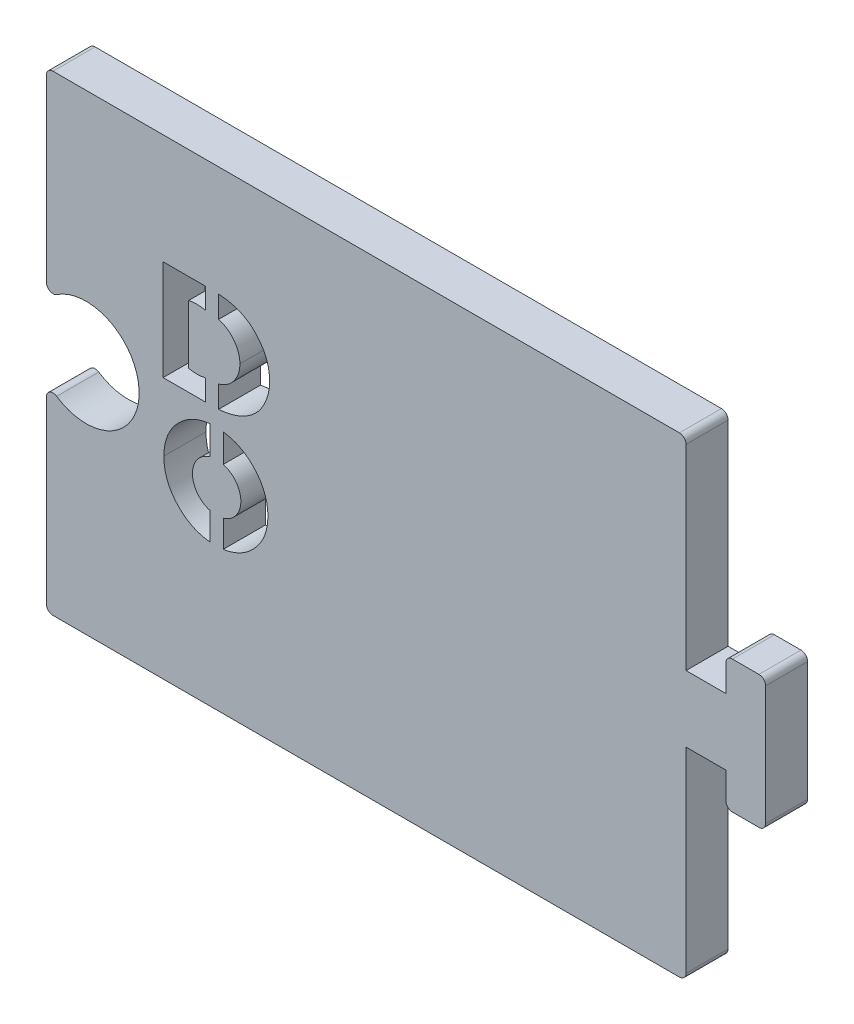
ISO-10303-21;
HEADER;
FILE_DESCRIPTION(('STEP AP214'),'2;1');
FILE_NAME('part.step','',(''),(''),'','','');
FILE_SCHEMA(('AUTOMOTIVE_DESIGN { 1 0 10303 214 1 1 1 1 }'));
ENDSEC;
DATA;
#1=APPLICATION_CONTEXT('core data for automotive mechanical design processes');
#2=APPLICATION_PROTOCOL_DEFINITION('international standard','automotive_design',2000,#1);
#3=PRODUCT_CONTEXT('',#1,'mechanical');
#4=PRODUCT('Part','Part','',(#3));
#5=PRODUCT_RELATED_PRODUCT_CATEGORY('part','',(#4));
#6=PRODUCT_DEFINITION_FORMATION('','',#4);
#7=PRODUCT_DEFINITION_CONTEXT('part definition',#1,'design');
#8=PRODUCT_DEFINITION('design','',#6,#7);
#9=PRODUCT_DEFINITION_SHAPE('','',#8);
#10=(LENGTH_UNIT() NAMED_UNIT(*) SI_UNIT(.MILLI.,.METRE.));
#11=(NAMED_UNIT(*) PLANE_ANGLE_UNIT() SI_UNIT($,.RADIAN.));
#12=(NAMED_UNIT(*) SI_UNIT($,.STERADIAN.) SOLID_ANGLE_UNIT());
#13=UNCERTAINTY_MEASURE_WITH_UNIT(LENGTH_MEASURE(1.E-05),#10,'distance_accuracy_value','');
#14=(GEOMETRIC_REPRESENTATION_CONTEXT(3) GLOBAL_UNCERTAINTY_ASSIGNED_CONTEXT((#13)) GLOBAL_UNIT_ASSIGNED_CONTEXT((#10,
#11,#12)) REPRESENTATION_CONTEXT('',''));
#15=CARTESIAN_POINT('',(0.,0.,0.));
#16=DIRECTION('',(0.,0.,1.));
#17=DIRECTION('',(1.,0.,0.));
#18=AXIS2_PLACEMENT_3D('',#15,#16,#17);
#19=CARTESIAN_POINT('',(12.7405175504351,18.4620640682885,-6.825));
#20=CARTESIAN_POINT('',(12.8789308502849,18.458963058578,-6.825));
#21=CARTESIAN_POINT('',(13.1510106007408,18.4528673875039,-6.825));
#22=CARTESIAN_POINT('',(13.5499137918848,18.3969239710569,-6.825));
#23=CARTESIAN_POINT('',(13.9314387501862,18.308385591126,-6.825));
#24=CARTESIAN_POINT('',(14.2962382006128,18.1837855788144,-6.825));
#25=CARTESIAN_POINT('',(14.6433976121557,18.0222731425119,-6.825));
#26=CARTESIAN_POINT('',(14.9740912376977,17.8257260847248,-6.825));
#27=CARTESIAN_POINT('',(15.2859858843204,17.5918870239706,-6.825));
#28=CARTESIAN_POINT('',(15.5771387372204,17.3261697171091,-6.825));
#29=CARTESIAN_POINT('',(15.842057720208,17.036506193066,-6.825));
#30=CARTESIAN_POINT('',(16.0767219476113,16.7300487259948,-6.825));
#31=CARTESIAN_POINT('',(16.2738045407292,16.408327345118,-6.825));
#32=CARTESIAN_POINT('',(16.4367806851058,16.0728418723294,-6.825));
#33=CARTESIAN_POINT('',(16.5605450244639,15.722308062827,-6.825));
#34=CARTESIAN_POINT('',(16.6496489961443,15.3579831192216,-6.825));
#35=CARTESIAN_POINT('',(16.7056901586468,14.9794502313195,-6.825));
#36=CARTESIAN_POINT('',(16.7118583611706,14.7218975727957,-6.825));
#37=CARTESIAN_POINT('',(16.7149869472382,14.5912637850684,-6.825));
#38=B_SPLINE_CURVE_WITH_KNOTS('',3,(#19,#20,#21,#22,#23,#24,#25,#26,#27,#28,#29,#30,#31,#32,#33,
#34,#35,#36,#37),.UNSPECIFIED.,.F.,.F.,(4,1,1,1,1,1,1,1,1,1,1,1,1,1,1,1,4),(0.,
0.0671724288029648,0.132041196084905,0.195150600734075,0.257102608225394,0.31884694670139,
0.380732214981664,0.443544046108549,0.507780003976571,0.571841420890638,0.633898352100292,
0.694894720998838,0.754716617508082,0.814660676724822,0.875012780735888,0.936604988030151,1.),.UNSPECIFIED.);
#39=DIRECTION('',(0.,0.,1.));
#40=VECTOR('',#39,1.);
#41=SURFACE_OF_LINEAR_EXTRUSION('',#38,#40);
#42=CARTESIAN_POINT('',(12.7405175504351,18.4620640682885,3.175));
#43=CARTESIAN_POINT('',(12.8789308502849,18.458963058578,3.175));
#44=CARTESIAN_POINT('',(13.1510106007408,18.4528673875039,3.175));
#45=CARTESIAN_POINT('',(13.5499137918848,18.3969239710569,3.175));
#46=CARTESIAN_POINT('',(13.9314387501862,18.308385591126,3.175));
#47=CARTESIAN_POINT('',(14.2962382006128,18.1837855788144,3.175));
#48=CARTESIAN_POINT('',(14.6433976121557,18.0222731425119,3.175));
#49=CARTESIAN_POINT('',(14.9740912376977,17.8257260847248,3.175));
#50=CARTESIAN_POINT('',(15.2859858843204,17.5918870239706,3.175));
#51=CARTESIAN_POINT('',(15.5771387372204,17.3261697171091,3.175));
#52=CARTESIAN_POINT('',(15.842057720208,17.036506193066,3.175));
#53=CARTESIAN_POINT('',(16.0767219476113,16.7300487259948,3.175));
#54=CARTESIAN_POINT('',(16.2738045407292,16.408327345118,3.175));
#55=CARTESIAN_POINT('',(16.4367806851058,16.0728418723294,3.175));
#56=CARTESIAN_POINT('',(16.5605450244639,15.722308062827,3.175));
#57=CARTESIAN_POINT('',(16.6496489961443,15.3579831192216,3.175));
#58=CARTESIAN_POINT('',(16.7056901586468,14.9794502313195,3.175));
#59=CARTESIAN_POINT('',(16.7118583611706,14.7218975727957,3.175));
#60=CARTESIAN_POINT('',(16.7149869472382,14.5912637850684,3.175));
#61=B_SPLINE_CURVE_WITH_KNOTS('',3,(#42,#43,#44,#45,#46,#47,#48,#49,#50,#51,#52,#53,#54,#55,#56,
#57,#58,#59,#60),.UNSPECIFIED.,.F.,.F.,(4,1,1,1,1,1,1,1,1,1,1,1,1,1,1,1,4),(0.,
0.0671724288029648,0.132041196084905,0.195150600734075,0.257102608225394,0.31884694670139,
0.380732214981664,0.443544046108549,0.507780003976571,0.571841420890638,0.633898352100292,
0.694894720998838,0.754716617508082,0.814660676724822,0.875012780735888,0.936604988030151,1.),.UNSPECIFIED.);
#62=CARTESIAN_POINT('',(13.3471660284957,18.4236028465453,3.175));
#63=VERTEX_POINT('',#62);
#64=CARTESIAN_POINT('',(16.7149869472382,14.5912637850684,3.175));
#65=VERTEX_POINT('',#64);
#66=EDGE_CURVE('E573',#63,#65,#61,.T.);
#67=ORIENTED_EDGE('',*,*,#66,.F.);
#68=DIRECTION('',(0.,0.,1.));
#69=VECTOR('',#68,1.);
#70=CARTESIAN_POINT('',(13.3471660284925,18.4236028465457,1.5875));
#71=LINE('',#70,#69);
#72=CARTESIAN_POINT('',(13.3471660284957,18.4236028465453,0.));
#73=VERTEX_POINT('',#72);
#74=EDGE_CURVE('E703',#63,#73,#71,.F.);
#75=ORIENTED_EDGE('',*,*,#74,.T.);
#76=CARTESIAN_POINT('',(12.7405175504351,18.4620640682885,0.));
#77=CARTESIAN_POINT('',(12.8789308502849,18.458963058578,0.));
#78=CARTESIAN_POINT('',(13.1510106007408,18.4528673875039,0.));
#79=CARTESIAN_POINT('',(13.5499137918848,18.3969239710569,0.));
#80=CARTESIAN_POINT('',(13.9314387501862,18.308385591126,0.));
#81=CARTESIAN_POINT('',(14.2962382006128,18.1837855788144,0.));
#82=CARTESIAN_POINT('',(14.6433976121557,18.0222731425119,0.));
#83=CARTESIAN_POINT('',(14.9740912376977,17.8257260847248,0.));
#84=CARTESIAN_POINT('',(15.2859858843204,17.5918870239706,0.));
#85=CARTESIAN_POINT('',(15.5771387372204,17.3261697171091,0.));
#86=CARTESIAN_POINT('',(15.842057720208,17.036506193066,0.));
#87=CARTESIAN_POINT('',(16.0767219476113,16.7300487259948,0.));
#88=CARTESIAN_POINT('',(16.2738045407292,16.408327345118,0.));
#89=CARTESIAN_POINT('',(16.4367806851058,16.0728418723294,0.));
#90=CARTESIAN_POINT('',(16.5605450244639,15.722308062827,0.));
#91=CARTESIAN_POINT('',(16.6496489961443,15.3579831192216,0.));
#92=CARTESIAN_POINT('',(16.7056901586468,14.9794502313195,0.));
#93=CARTESIAN_POINT('',(16.7118583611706,14.7218975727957,0.));
#94=CARTESIAN_POINT('',(16.7149869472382,14.5912637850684,0.));
#95=B_SPLINE_CURVE_WITH_KNOTS('',3,(#76,#77,#78,#79,#80,#81,#82,#83,#84,#85,#86,#87,#88,#89,#90,
#91,#92,#93,#94),.UNSPECIFIED.,.F.,.F.,(4,1,1,1,1,1,1,1,1,1,1,1,1,1,1,1,4),(0.,
0.0671724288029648,0.132041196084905,0.195150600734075,0.257102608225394,0.31884694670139,
0.380732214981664,0.443544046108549,0.507780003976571,0.571841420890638,0.633898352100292,
0.694894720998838,0.754716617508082,0.814660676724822,0.875012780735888,0.936604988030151,1.),.UNSPECIFIED.);
#96=CARTESIAN_POINT('',(16.7149869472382,14.5912637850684,0.));
#97=VERTEX_POINT('',#96);
#98=EDGE_CURVE('E450',#73,#97,#95,.T.);
#99=ORIENTED_EDGE('',*,*,#98,.T.);
#100=DIRECTION('',(0.,0.,1.));
#101=VECTOR('',#100,1.);
#102=CARTESIAN_POINT('',(16.7149869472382,14.5912637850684,-6.825));
#103=LINE('',#102,#101);
#104=EDGE_CURVE('E558',#97,#65,#103,.T.);
#105=ORIENTED_EDGE('',*,*,#104,.T.);
#106=EDGE_LOOP('',(#67,#75,#99,#105));
#107=FACE_BOUND('',#106,.T.);
#108=ADVANCED_FACE('F33',(#107),#41,.T.);
#109=CARTESIAN_POINT('',(16.7149869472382,14.5912637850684,-6.825));
#110=CARTESIAN_POINT('',(16.7118638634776,14.4601417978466,-6.825));
#111=CARTESIAN_POINT('',(16.7057062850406,14.2016172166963,-6.825));
#112=CARTESIAN_POINT('',(16.6495815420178,13.8216639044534,-6.825));
#113=CARTESIAN_POINT('',(16.5609019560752,13.4562122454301,-6.825));
#114=CARTESIAN_POINT('',(16.436070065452,13.1046656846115,-6.825));
#115=CARTESIAN_POINT('',(16.2742996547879,12.7671906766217,-6.825));
#116=CARTESIAN_POINT('',(16.0766800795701,12.4437844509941,-6.825));
#117=CARTESIAN_POINT('',(15.8421310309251,12.135794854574,-6.825));
#118=CARTESIAN_POINT('',(15.5771104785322,11.8447827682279,-6.825));
#119=CARTESIAN_POINT('',(15.2864456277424,11.5774773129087,-6.825));
#120=CARTESIAN_POINT('',(14.9740547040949,11.3436912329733,-6.825));
#121=CARTESIAN_POINT('',(14.643733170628,11.147427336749,-6.825));
#122=CARTESIAN_POINT('',(14.2967023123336,10.9853096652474,-6.825));
#123=CARTESIAN_POINT('',(13.9321191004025,10.8594400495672,-6.825));
#124=CARTESIAN_POINT('',(13.5498925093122,10.7710687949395,-6.825));
#125=CARTESIAN_POINT('',(13.1510162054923,10.715041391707,-6.825));
#126=CARTESIAN_POINT('',(12.8789327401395,10.7089573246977,-6.825));
#127=CARTESIAN_POINT('',(12.7405175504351,10.7058622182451,-6.825));
#128=B_SPLINE_CURVE_WITH_KNOTS('',3,(#109,#110,#111,#112,#113,#114,#115,#116,#117,#118,#119,
#120,#121,#122,#123,#124,#125,#126,#127),.UNSPECIFIED.,.F.,.F.,(4,1,1,1,1,1,1,1,1,1,1,1,1,1,1,1,
4),(0.,0.0635081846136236,0.125214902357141,0.185679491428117,0.24550776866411,0.30563931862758,
0.366719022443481,0.42884396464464,0.492955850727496,0.557226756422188,0.619917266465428,
0.681683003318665,0.743094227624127,0.805226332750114,0.86821384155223,0.9329573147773,1.),.UNSPECIFIED.);
#129=DIRECTION('',(0.,0.,1.));
#130=VECTOR('',#129,1.);
#131=SURFACE_OF_LINEAR_EXTRUSION('',#128,#130);
#132=CARTESIAN_POINT('',(16.7149869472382,14.5912637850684,0.));
#133=CARTESIAN_POINT('',(16.7118638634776,14.4601417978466,0.));
#134=CARTESIAN_POINT('',(16.7057062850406,14.2016172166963,0.));
#135=CARTESIAN_POINT('',(16.6495815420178,13.8216639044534,0.));
#136=CARTESIAN_POINT('',(16.5609019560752,13.4562122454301,0.));
#137=CARTESIAN_POINT('',(16.436070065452,13.1046656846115,0.));
#138=CARTESIAN_POINT('',(16.2742996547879,12.7671906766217,0.));
#139=CARTESIAN_POINT('',(16.0766800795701,12.4437844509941,0.));
#140=CARTESIAN_POINT('',(15.8421310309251,12.135794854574,0.));
#141=CARTESIAN_POINT('',(15.5771104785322,11.8447827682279,0.));
#142=CARTESIAN_POINT('',(15.2864456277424,11.5774773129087,0.));
#143=CARTESIAN_POINT('',(14.9740547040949,11.3436912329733,0.));
#144=CARTESIAN_POINT('',(14.643733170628,11.147427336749,0.));
#145=CARTESIAN_POINT('',(14.2967023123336,10.9853096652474,0.));
#146=CARTESIAN_POINT('',(13.9321191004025,10.8594400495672,0.));
#147=CARTESIAN_POINT('',(13.5498925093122,10.7710687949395,0.));
#148=CARTESIAN_POINT('',(13.1510162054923,10.715041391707,0.));
#149=CARTESIAN_POINT('',(12.8789327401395,10.7089573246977,0.));
#150=CARTESIAN_POINT('',(12.7405175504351,10.7058622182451,0.));
#151=B_SPLINE_CURVE_WITH_KNOTS('',3,(#132,#133,#134,#135,#136,#137,#138,#139,#140,#141,#142,
#143,#144,#145,#146,#147,#148,#149,#150),.UNSPECIFIED.,.F.,.F.,(4,1,1,1,1,1,1,1,1,1,1,1,1,1,1,1,
4),(0.,0.0635081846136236,0.125214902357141,0.185679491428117,0.24550776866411,0.30563931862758,
0.366719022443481,0.42884396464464,0.492955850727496,0.557226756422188,0.619917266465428,
0.681683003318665,0.743094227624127,0.805226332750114,0.86821384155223,0.9329573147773,1.),.UNSPECIFIED.);
#152=CARTESIAN_POINT('',(13.3471660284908,10.7443428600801,0.));
#153=VERTEX_POINT('',#152);
#154=EDGE_CURVE('E564',#97,#153,#151,.T.);
#155=ORIENTED_EDGE('',*,*,#154,.T.);
#156=DIRECTION('',(0.,0.,1.));
#157=VECTOR('',#156,1.);
#158=CARTESIAN_POINT('',(13.3471660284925,10.7443428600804,1.5875));
#159=LINE('',#158,#157);
#160=CARTESIAN_POINT('',(13.3471660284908,10.7443428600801,3.175));
#161=VERTEX_POINT('',#160);
#162=EDGE_CURVE('E701',#153,#161,#159,.T.);
#163=ORIENTED_EDGE('',*,*,#162,.T.);
#164=CARTESIAN_POINT('',(16.7149869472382,14.5912637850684,3.175));
#165=CARTESIAN_POINT('',(16.7118638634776,14.4601417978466,3.175));
#166=CARTESIAN_POINT('',(16.7057062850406,14.2016172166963,3.175));
#167=CARTESIAN_POINT('',(16.6495815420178,13.8216639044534,3.175));
#168=CARTESIAN_POINT('',(16.5609019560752,13.4562122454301,3.175));
#169=CARTESIAN_POINT('',(16.436070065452,13.1046656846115,3.175));
#170=CARTESIAN_POINT('',(16.2742996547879,12.7671906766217,3.175));
#171=CARTESIAN_POINT('',(16.0766800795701,12.4437844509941,3.175));
#172=CARTESIAN_POINT('',(15.8421310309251,12.135794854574,3.175));
#173=CARTESIAN_POINT('',(15.5771104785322,11.8447827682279,3.175));
#174=CARTESIAN_POINT('',(15.2864456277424,11.5774773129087,3.175));
#175=CARTESIAN_POINT('',(14.9740547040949,11.3436912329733,3.175));
#176=CARTESIAN_POINT('',(14.643733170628,11.147427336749,3.175));
#177=CARTESIAN_POINT('',(14.2967023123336,10.9853096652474,3.175));
#178=CARTESIAN_POINT('',(13.9321191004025,10.8594400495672,3.175));
#179=CARTESIAN_POINT('',(13.5498925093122,10.7710687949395,3.175));
#180=CARTESIAN_POINT('',(13.1510162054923,10.715041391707,3.175));
#181=CARTESIAN_POINT('',(12.8789327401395,10.7089573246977,3.175));
#182=CARTESIAN_POINT('',(12.7405175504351,10.7058622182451,3.175));
#183=B_SPLINE_CURVE_WITH_KNOTS('',3,(#164,#165,#166,#167,#168,#169,#170,#171,#172,#173,#174,
#175,#176,#177,#178,#179,#180,#181,#182),.UNSPECIFIED.,.F.,.F.,(4,1,1,1,1,1,1,1,1,1,1,1,1,1,1,1,
4),(0.,0.0635081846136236,0.125214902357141,0.185679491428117,0.24550776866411,0.30563931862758,
0.366719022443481,0.42884396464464,0.492955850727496,0.557226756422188,0.619917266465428,
0.681683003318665,0.743094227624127,0.805226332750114,0.86821384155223,0.9329573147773,1.),.UNSPECIFIED.);
#184=EDGE_CURVE('E580',#65,#161,#183,.T.);
#185=ORIENTED_EDGE('',*,*,#184,.F.);
#186=ORIENTED_EDGE('',*,*,#104,.F.);
#187=EDGE_LOOP('',(#155,#163,#185,#186));
#188=FACE_BOUND('',#187,.T.);
#189=ADVANCED_FACE('F665',(#188),#131,.T.);
#190=CARTESIAN_POINT('',(12.7405175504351,10.7058622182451,-6.825));
#191=CARTESIAN_POINT('',(12.6079627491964,10.7091591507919,-6.825));
#192=CARTESIAN_POINT('',(12.3466520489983,10.7156585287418,-6.825));
#193=CARTESIAN_POINT('',(11.9620457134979,10.7692773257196,-6.825));
#194=CARTESIAN_POINT('',(11.5935186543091,10.8585161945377,-6.825));
#195=CARTESIAN_POINT('',(11.2397192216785,10.9813874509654,-6.825));
#196=CARTESIAN_POINT('',(10.9025637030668,11.1419896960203,-6.825));
#197=CARTESIAN_POINT('',(10.5800186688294,11.3368521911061,-6.825));
#198=CARTESIAN_POINT('',(10.2736252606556,11.5676159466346,-6.825));
#199=CARTESIAN_POINT('',(9.98675288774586,11.8306973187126,-6.825));
#200=CARTESIAN_POINT('',(9.72439010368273,12.1179350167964,-6.825));
#201=CARTESIAN_POINT('',(9.49519382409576,12.4254605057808,-6.825));
#202=CARTESIAN_POINT('',(9.2990469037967,12.747276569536,-6.825));
#203=CARTESIAN_POINT('',(9.14179848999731,13.0868929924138,-6.825));
#204=CARTESIAN_POINT('',(9.01575229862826,13.4403239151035,-6.825));
#205=CARTESIAN_POINT('',(8.92921426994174,13.8106227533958,-6.825));
#206=CARTESIAN_POINT('',(8.87499276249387,14.1959037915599,-6.825));
#207=CARTESIAN_POINT('',(8.868586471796,14.4582093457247,-6.825));
#208=CARTESIAN_POINT('',(8.86533688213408,14.5912637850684,-6.825));
#209=B_SPLINE_CURVE_WITH_KNOTS('',3,(#190,#191,#192,#193,#194,#195,#196,#197,#198,#199,#200,
#201,#202,#203,#204,#205,#206,#207,#208),.UNSPECIFIED.,.F.,.F.,(4,1,1,1,1,1,1,1,1,1,1,1,1,1,1,1,
4),(0.,0.065030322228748,0.128196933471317,0.190125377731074,0.250858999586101,
0.311651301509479,0.373054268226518,0.43548960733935,0.499564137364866,0.563815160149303,
0.626107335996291,0.68751030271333,0.748416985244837,0.809455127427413,0.871327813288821,
0.934731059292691,1.),.UNSPECIFIED.);
#210=DIRECTION('',(0.,0.,1.));
#211=VECTOR('',#210,1.);
#212=SURFACE_OF_LINEAR_EXTRUSION('',#209,#211);
#213=CARTESIAN_POINT('',(12.7405175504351,10.7058622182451,3.175));
#214=CARTESIAN_POINT('',(12.6079627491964,10.7091591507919,3.175));
#215=CARTESIAN_POINT('',(12.3466520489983,10.7156585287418,3.175));
#216=CARTESIAN_POINT('',(11.9620457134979,10.7692773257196,3.175));
#217=CARTESIAN_POINT('',(11.5935186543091,10.8585161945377,3.175));
#218=CARTESIAN_POINT('',(11.2397192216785,10.9813874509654,3.175));
#219=CARTESIAN_POINT('',(10.9025637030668,11.1419896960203,3.175));
#220=CARTESIAN_POINT('',(10.5800186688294,11.3368521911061,3.175));
#221=CARTESIAN_POINT('',(10.2736252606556,11.5676159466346,3.175));
#222=CARTESIAN_POINT('',(9.98675288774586,11.8306973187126,3.175));
#223=CARTESIAN_POINT('',(9.72439010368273,12.1179350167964,3.175));
#224=CARTESIAN_POINT('',(9.49519382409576,12.4254605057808,3.175));
#225=CARTESIAN_POINT('',(9.2990469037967,12.747276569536,3.175));
#226=CARTESIAN_POINT('',(9.14179848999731,13.0868929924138,3.175));
#227=CARTESIAN_POINT('',(9.01575229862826,13.4403239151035,3.175));
#228=CARTESIAN_POINT('',(8.92921426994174,13.8106227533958,3.175));
#229=CARTESIAN_POINT('',(8.87499276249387,14.1959037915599,3.175));
#230=CARTESIAN_POINT('',(8.868586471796,14.4582093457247,3.175));
#231=CARTESIAN_POINT('',(8.86533688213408,14.5912637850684,3.175));
#232=B_SPLINE_CURVE_WITH_KNOTS('',3,(#213,#214,#215,#216,#217,#218,#219,#220,#221,#222,#223,
#224,#225,#226,#227,#228,#229,#230,#231),.UNSPECIFIED.,.F.,.F.,(4,1,1,1,1,1,1,1,1,1,1,1,1,1,1,1,
4),(0.,0.065030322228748,0.128196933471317,0.190125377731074,0.250858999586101,
0.311651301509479,0.373054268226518,0.43548960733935,0.499564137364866,0.563815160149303,
0.626107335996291,0.68751030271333,0.748416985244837,0.809455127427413,0.871327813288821,
0.934731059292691,1.),.UNSPECIFIED.);
#233=CARTESIAN_POINT('',(12.347166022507,10.7230711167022,3.175));
#234=VERTEX_POINT('',#233);
#235=CARTESIAN_POINT('',(8.86533688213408,14.5912637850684,3.175));
#236=VERTEX_POINT('',#235);
#237=EDGE_CURVE('E549',#234,#236,#232,.T.);
#238=ORIENTED_EDGE('',*,*,#237,.F.);
#239=DIRECTION('',(0.,0.,1.));
#240=VECTOR('',#239,1.);
#241=CARTESIAN_POINT('',(12.3471660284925,10.7230711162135,1.5875));
#242=LINE('',#241,#240);
#243=CARTESIAN_POINT('',(12.3471660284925,10.7230711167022,0.));
#244=VERTEX_POINT('',#243);
#245=EDGE_CURVE('E698',#234,#244,#242,.F.);
#246=ORIENTED_EDGE('',*,*,#245,.T.);
#247=CARTESIAN_POINT('',(12.7405175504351,10.7058622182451,0.));
#248=CARTESIAN_POINT('',(12.6079627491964,10.7091591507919,0.));
#249=CARTESIAN_POINT('',(12.3466520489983,10.7156585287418,0.));
#250=CARTESIAN_POINT('',(11.9620457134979,10.7692773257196,0.));
#251=CARTESIAN_POINT('',(11.5935186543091,10.8585161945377,0.));
#252=CARTESIAN_POINT('',(11.2397192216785,10.9813874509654,0.));
#253=CARTESIAN_POINT('',(10.9025637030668,11.1419896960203,0.));
#254=CARTESIAN_POINT('',(10.5800186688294,11.3368521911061,0.));
#255=CARTESIAN_POINT('',(10.2736252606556,11.5676159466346,0.));
#256=CARTESIAN_POINT('',(9.98675288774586,11.8306973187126,0.));
#257=CARTESIAN_POINT('',(9.72439010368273,12.1179350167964,0.));
#258=CARTESIAN_POINT('',(9.49519382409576,12.4254605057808,0.));
#259=CARTESIAN_POINT('',(9.2990469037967,12.747276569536,0.));
#260=CARTESIAN_POINT('',(9.14179848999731,13.0868929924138,0.));
#261=CARTESIAN_POINT('',(9.01575229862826,13.4403239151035,0.));
#262=CARTESIAN_POINT('',(8.92921426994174,13.8106227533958,0.));
#263=CARTESIAN_POINT('',(8.87499276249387,14.1959037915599,0.));
#264=CARTESIAN_POINT('',(8.868586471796,14.4582093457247,0.));
#265=CARTESIAN_POINT('',(8.86533688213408,14.5912637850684,0.));
#266=B_SPLINE_CURVE_WITH_KNOTS('',3,(#247,#248,#249,#250,#251,#252,#253,#254,#255,#256,#257,
#258,#259,#260,#261,#262,#263,#264,#265),.UNSPECIFIED.,.F.,.F.,(4,1,1,1,1,1,1,1,1,1,1,1,1,1,1,1,
4),(0.,0.065030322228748,0.128196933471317,0.190125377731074,0.250858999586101,
0.311651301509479,0.373054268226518,0.43548960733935,0.499564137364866,0.563815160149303,
0.626107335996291,0.68751030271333,0.748416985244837,0.809455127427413,0.871327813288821,
0.934731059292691,1.),.UNSPECIFIED.);
#267=CARTESIAN_POINT('',(8.86533688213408,14.5912637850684,0.));
#268=VERTEX_POINT('',#267);
#269=EDGE_CURVE('E569',#244,#268,#266,.T.);
#270=ORIENTED_EDGE('',*,*,#269,.T.);
#271=DIRECTION('',(0.,0.,1.));
#272=VECTOR('',#271,1.);
#273=CARTESIAN_POINT('',(8.86533688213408,14.5912637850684,-6.825));
#274=LINE('',#273,#272);
#275=EDGE_CURVE('E565',#268,#236,#274,.T.);
#276=ORIENTED_EDGE('',*,*,#275,.T.);
#277=EDGE_LOOP('',(#238,#246,#270,#276));
#278=FACE_BOUND('',#277,.T.);
#279=ADVANCED_FACE('F614',(#278),#212,.T.);
#280=CARTESIAN_POINT('',(8.86533688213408,14.5912637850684,-6.825));
#281=CARTESIAN_POINT('',(8.86864641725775,14.7238154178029,-6.825));
#282=CARTESIAN_POINT('',(8.87517063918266,14.985119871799,-6.825));
#283=CARTESIAN_POINT('',(8.92854313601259,15.3693021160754,-6.825));
#284=CARTESIAN_POINT('',(9.01826648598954,15.7372155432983,-6.825));
#285=CARTESIAN_POINT('',(9.14078056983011,16.0906432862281,-6.825));
#286=CARTESIAN_POINT('',(9.30138409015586,16.4270218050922,-6.825));
#287=CARTESIAN_POINT('',(9.49464519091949,16.7493297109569,-6.825));
#288=CARTESIAN_POINT('',(9.72613807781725,17.0539070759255,-6.825));
#289=CARTESIAN_POINT('',(9.98862030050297,17.340186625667,-6.825));
#290=CARTESIAN_POINT('',(10.2745633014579,17.6034646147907,-6.825));
#291=CARTESIAN_POINT('',(10.5820513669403,17.8321851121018,-6.825));
#292=CARTESIAN_POINT('',(10.9035159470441,18.0279830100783,-6.825));
#293=CARTESIAN_POINT('',(11.2419367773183,18.1856400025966,-6.825));
#294=CARTESIAN_POINT('',(11.5939426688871,18.3116325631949,-6.825));
#295=CARTESIAN_POINT('',(11.9627815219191,18.3981915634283,-6.825));
#296=CARTESIAN_POINT('',(12.3466120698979,18.4524084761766,-6.825));
#297=CARTESIAN_POINT('',(12.6079492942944,18.4588144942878,-6.825));
#298=CARTESIAN_POINT('',(12.7405175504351,18.4620640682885,-6.825));
#299=B_SPLINE_CURVE_WITH_KNOTS('',3,(#280,#281,#282,#283,#284,#285,#286,#287,#288,#289,#290,
#291,#292,#293,#294,#295,#296,#297,#298),.UNSPECIFIED.,.F.,.F.,(4,1,1,1,1,1,1,1,1,1,1,1,1,1,1,1,
4),(0.,0.0651656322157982,0.128463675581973,0.190288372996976,0.251148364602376,
0.312067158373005,0.373269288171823,0.435643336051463,0.499851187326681,0.564059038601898,
0.626480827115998,0.688011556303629,0.748828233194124,0.809767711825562,0.871536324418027,
0.934834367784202,1.),.UNSPECIFIED.);
#300=DIRECTION('',(0.,0.,1.));
#301=VECTOR('',#300,1.);
#302=SURFACE_OF_LINEAR_EXTRUSION('',#299,#301);
#303=CARTESIAN_POINT('',(8.86533688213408,14.5912637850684,0.));
#304=CARTESIAN_POINT('',(8.86864641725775,14.7238154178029,0.));
#305=CARTESIAN_POINT('',(8.87517063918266,14.985119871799,0.));
#306=CARTESIAN_POINT('',(8.92854313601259,15.3693021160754,0.));
#307=CARTESIAN_POINT('',(9.01826648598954,15.7372155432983,0.));
#308=CARTESIAN_POINT('',(9.14078056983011,16.0906432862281,0.));
#309=CARTESIAN_POINT('',(9.30138409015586,16.4270218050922,0.));
#310=CARTESIAN_POINT('',(9.49464519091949,16.7493297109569,0.));
#311=CARTESIAN_POINT('',(9.72613807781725,17.0539070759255,0.));
#312=CARTESIAN_POINT('',(9.98862030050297,17.340186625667,0.));
#313=CARTESIAN_POINT('',(10.2745633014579,17.6034646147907,0.));
#314=CARTESIAN_POINT('',(10.5820513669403,17.8321851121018,0.));
#315=CARTESIAN_POINT('',(10.9035159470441,18.0279830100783,0.));
#316=CARTESIAN_POINT('',(11.2419367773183,18.1856400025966,0.));
#317=CARTESIAN_POINT('',(11.5939426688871,18.3116325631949,0.));
#318=CARTESIAN_POINT('',(11.9627815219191,18.3981915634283,0.));
#319=CARTESIAN_POINT('',(12.3466120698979,18.4524084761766,0.));
#320=CARTESIAN_POINT('',(12.6079492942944,18.4588144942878,0.));
#321=CARTESIAN_POINT('',(12.7405175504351,18.4620640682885,0.));
#322=B_SPLINE_CURVE_WITH_KNOTS('',3,(#303,#304,#305,#306,#307,#308,#309,#310,#311,#312,#313,
#314,#315,#316,#317,#318,#319,#320,#321),.UNSPECIFIED.,.F.,.F.,(4,1,1,1,1,1,1,1,1,1,1,1,1,1,1,1,
4),(0.,0.0651656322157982,0.128463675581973,0.190288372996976,0.251148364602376,
0.312067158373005,0.373269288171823,0.435643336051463,0.499851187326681,0.564059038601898,
0.626480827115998,0.688011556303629,0.748828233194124,0.809767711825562,0.871536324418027,
0.934834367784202,1.),.UNSPECIFIED.);
#323=CARTESIAN_POINT('',(12.3471660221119,18.4448579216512,0.));
#324=VERTEX_POINT('',#323);
#325=EDGE_CURVE('E568',#268,#324,#322,.T.);
#326=ORIENTED_EDGE('',*,*,#325,.T.);
#327=DIRECTION('',(0.,0.,1.));
#328=VECTOR('',#327,1.);
#329=CARTESIAN_POINT('',(12.3471660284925,18.4448579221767,1.5875));
#330=LINE('',#329,#328);
#331=CARTESIAN_POINT('',(12.3471660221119,18.4448579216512,3.175));
#332=VERTEX_POINT('',#331);
#333=EDGE_CURVE('E696',#324,#332,#330,.T.);
#334=ORIENTED_EDGE('',*,*,#333,.T.);
#335=CARTESIAN_POINT('',(8.86533688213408,14.5912637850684,3.175));
#336=CARTESIAN_POINT('',(8.86864641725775,14.7238154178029,3.175));
#337=CARTESIAN_POINT('',(8.87517063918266,14.985119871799,3.175));
#338=CARTESIAN_POINT('',(8.92854313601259,15.3693021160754,3.175));
#339=CARTESIAN_POINT('',(9.01826648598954,15.7372155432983,3.175));
#340=CARTESIAN_POINT('',(9.14078056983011,16.0906432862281,3.175));
#341=CARTESIAN_POINT('',(9.30138409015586,16.4270218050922,3.175));
#342=CARTESIAN_POINT('',(9.49464519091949,16.7493297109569,3.175));
#343=CARTESIAN_POINT('',(9.72613807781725,17.0539070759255,3.175));
#344=CARTESIAN_POINT('',(9.98862030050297,17.340186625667,3.175));
#345=CARTESIAN_POINT('',(10.2745633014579,17.6034646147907,3.175));
#346=CARTESIAN_POINT('',(10.5820513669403,17.8321851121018,3.175));
#347=CARTESIAN_POINT('',(10.9035159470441,18.0279830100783,3.175));
#348=CARTESIAN_POINT('',(11.2419367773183,18.1856400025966,3.175));
#349=CARTESIAN_POINT('',(11.5939426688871,18.3116325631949,3.175));
#350=CARTESIAN_POINT('',(11.9627815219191,18.3981915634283,3.175));
#351=CARTESIAN_POINT('',(12.3466120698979,18.4524084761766,3.175));
#352=CARTESIAN_POINT('',(12.6079492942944,18.4588144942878,3.175));
#353=CARTESIAN_POINT('',(12.7405175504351,18.4620640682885,3.175));
#354=B_SPLINE_CURVE_WITH_KNOTS('',3,(#335,#336,#337,#338,#339,#340,#341,#342,#343,#344,#345,
#346,#347,#348,#349,#350,#351,#352,#353),.UNSPECIFIED.,.F.,.F.,(4,1,1,1,1,1,1,1,1,1,1,1,1,1,1,1,
4),(0.,0.0651656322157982,0.128463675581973,0.190288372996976,0.251148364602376,
0.312067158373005,0.373269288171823,0.435643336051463,0.499851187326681,0.564059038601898,
0.626480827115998,0.688011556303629,0.748828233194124,0.809767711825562,0.871536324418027,
0.934834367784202,1.),.UNSPECIFIED.);
#355=EDGE_CURVE('E347',#236,#332,#354,.T.);
#356=ORIENTED_EDGE('',*,*,#355,.F.);
#357=ORIENTED_EDGE('',*,*,#275,.F.);
#358=EDGE_LOOP('',(#326,#334,#356,#357));
#359=FACE_BOUND('',#358,.T.);
#360=ADVANCED_FACE('F609',(#359),#302,.T.);
#361=CARTESIAN_POINT('',(16.846299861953,23.4646021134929,-6.825));
#362=CARTESIAN_POINT('',(16.8449929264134,23.3837534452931,-6.825));
#363=CARTESIAN_POINT('',(16.8423814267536,23.2222028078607,-6.825));
#364=CARTESIAN_POINT('',(16.8183039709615,22.9816826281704,-6.825));
#365=CARTESIAN_POINT('',(16.7788366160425,22.743640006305,-6.825));
#366=CARTESIAN_POINT('',(16.7228783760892,22.5087639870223,-6.825));
#367=CARTESIAN_POINT('',(16.6530734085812,22.2758639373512,-6.825));
#368=CARTESIAN_POINT('',(16.5662480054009,22.0458189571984,-6.825));
#369=CARTESIAN_POINT('',(16.4640422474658,21.8187576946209,-6.825));
#370=CARTESIAN_POINT('',(16.3479273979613,21.5951021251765,-6.825));
#371=CARTESIAN_POINT('',(16.2149806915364,21.379606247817,-6.825));
#372=CARTESIAN_POINT('',(16.0681485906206,21.1729899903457,-6.825));
#373=CARTESIAN_POINT('',(15.9039434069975,20.9801128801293,-6.825));
#374=CARTESIAN_POINT('',(15.7243508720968,20.7995402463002,-6.825));
#375=CARTESIAN_POINT('',(15.530551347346,20.6301847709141,-6.825));
#376=CARTESIAN_POINT('',(15.3204738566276,20.4733142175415,-6.825));
#377=CARTESIAN_POINT('',(15.0951400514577,20.3291600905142,-6.825));
#378=CARTESIAN_POINT('',(14.8558048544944,20.1957602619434,-6.825));
#379=CARTESIAN_POINT('',(14.6019719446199,20.0778628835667,-6.825));
#380=CARTESIAN_POINT('',(14.334873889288,19.9758233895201,-6.825));
#381=CARTESIAN_POINT('',(14.0558843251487,19.8873054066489,-6.825));
#382=CARTESIAN_POINT('',(13.7627126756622,19.8184837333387,-6.825));
#383=CARTESIAN_POINT('',(13.4572692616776,19.762290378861,-6.825));
#384=CARTESIAN_POINT('',(13.1387976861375,19.7242377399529,-6.825));
#385=CARTESIAN_POINT('',(12.8080346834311,19.697689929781,-6.825));
#386=CARTESIAN_POINT('',(12.5832671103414,19.6956097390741,-6.825));
#387=CARTESIAN_POINT('',(12.4688350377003,19.6945506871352,-6.825));
#388=B_SPLINE_CURVE_WITH_KNOTS('',3,(#361,#362,#363,#364,#365,#366,#367,#368,#369,#370,#371,
#372,#373,#374,#375,#376,#377,#378,#379,#380,#381,#382,#383,#384,#385,#386,#387),.UNSPECIFIED.,
.F.,.F.,(4,1,1,1,1,1,1,1,1,1,1,1,1,1,1,1,1,1,1,1,1,1,1,1,4),(0.,0.0373640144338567,
0.074660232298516,0.111610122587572,0.148827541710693,0.186194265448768,0.223928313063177,
0.262397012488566,0.301240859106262,0.340328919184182,0.379350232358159,0.418297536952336,
0.457274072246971,0.496978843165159,0.537160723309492,0.578349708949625,0.620546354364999,
0.663727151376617,0.707598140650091,0.752640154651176,0.798914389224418,0.846706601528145,
0.89612750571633,0.947117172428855,1.),.UNSPECIFIED.);
#389=DIRECTION('',(0.,0.,1.));
#390=VECTOR('',#389,1.);
#391=SURFACE_OF_LINEAR_EXTRUSION('',#388,#390);
#392=CARTESIAN_POINT('',(16.846299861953,23.4646021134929,0.));
#393=CARTESIAN_POINT('',(16.8449929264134,23.3837534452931,0.));
#394=CARTESIAN_POINT('',(16.8423814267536,23.2222028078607,0.));
#395=CARTESIAN_POINT('',(16.8183039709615,22.9816826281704,0.));
#396=CARTESIAN_POINT('',(16.7788366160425,22.743640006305,0.));
#397=CARTESIAN_POINT('',(16.7228783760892,22.5087639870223,0.));
#398=CARTESIAN_POINT('',(16.6530734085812,22.2758639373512,0.));
#399=CARTESIAN_POINT('',(16.5662480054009,22.0458189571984,0.));
#400=CARTESIAN_POINT('',(16.4640422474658,21.8187576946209,0.));
#401=CARTESIAN_POINT('',(16.3479273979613,21.5951021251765,0.));
#402=CARTESIAN_POINT('',(16.2149806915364,21.379606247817,0.));
#403=CARTESIAN_POINT('',(16.0681485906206,21.1729899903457,0.));
#404=CARTESIAN_POINT('',(15.9039434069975,20.9801128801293,0.));
#405=CARTESIAN_POINT('',(15.7243508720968,20.7995402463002,0.));
#406=CARTESIAN_POINT('',(15.530551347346,20.6301847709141,0.));
#407=CARTESIAN_POINT('',(15.3204738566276,20.4733142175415,0.));
#408=CARTESIAN_POINT('',(15.0951400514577,20.3291600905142,0.));
#409=CARTESIAN_POINT('',(14.8558048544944,20.1957602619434,0.));
#410=CARTESIAN_POINT('',(14.6019719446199,20.0778628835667,0.));
#411=CARTESIAN_POINT('',(14.334873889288,19.9758233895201,0.));
#412=CARTESIAN_POINT('',(14.0558843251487,19.8873054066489,0.));
#413=CARTESIAN_POINT('',(13.7627126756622,19.8184837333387,0.));
#414=CARTESIAN_POINT('',(13.4572692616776,19.762290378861,0.));
#415=CARTESIAN_POINT('',(13.1387976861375,19.7242377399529,0.));
#416=CARTESIAN_POINT('',(12.8080346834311,19.697689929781,0.));
#417=CARTESIAN_POINT('',(12.5832671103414,19.6956097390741,0.));
#418=CARTESIAN_POINT('',(12.4688350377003,19.6945506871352,0.));
#419=B_SPLINE_CURVE_WITH_KNOTS('',3,(#392,#393,#394,#395,#396,#397,#398,#399,#400,#401,#402,
#403,#404,#405,#406,#407,#408,#409,#410,#411,#412,#413,#414,#415,#416,#417,#418),.UNSPECIFIED.,
.F.,.F.,(4,1,1,1,1,1,1,1,1,1,1,1,1,1,1,1,1,1,1,1,1,1,1,1,4),(0.,0.0373640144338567,
0.074660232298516,0.111610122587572,0.148827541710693,0.186194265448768,0.223928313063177,
0.262397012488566,0.301240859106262,0.340328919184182,0.379350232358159,0.418297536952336,
0.457274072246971,0.496978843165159,0.537160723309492,0.578349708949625,0.620546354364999,
0.663727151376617,0.707598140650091,0.752640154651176,0.798914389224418,0.846706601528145,
0.89612750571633,0.947117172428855,1.),.UNSPECIFIED.);
#420=CARTESIAN_POINT('',(16.846299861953,23.4646021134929,0.));
#421=VERTEX_POINT('',#420);
#422=CARTESIAN_POINT('',(12.9936486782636,19.7133012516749,0.));
#423=VERTEX_POINT('',#422);
#424=EDGE_CURVE('E454',#421,#423,#419,.T.);
#425=ORIENTED_EDGE('',*,*,#424,.T.);
#426=DIRECTION('',(0.,0.,1.));
#427=VECTOR('',#426,1.);
#428=CARTESIAN_POINT('',(12.9936486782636,19.7133012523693,1.5875));
#429=LINE('',#428,#427);
#430=CARTESIAN_POINT('',(12.9936486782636,19.7133012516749,3.175));
#431=VERTEX_POINT('',#430);
#432=EDGE_CURVE('E693',#423,#431,#429,.T.);
#433=ORIENTED_EDGE('',*,*,#432,.T.);
#434=CARTESIAN_POINT('',(16.846299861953,23.4646021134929,3.175));
#435=CARTESIAN_POINT('',(16.8449929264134,23.3837534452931,3.175));
#436=CARTESIAN_POINT('',(16.8423814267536,23.2222028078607,3.175));
#437=CARTESIAN_POINT('',(16.8183039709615,22.9816826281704,3.175));
#438=CARTESIAN_POINT('',(16.7788366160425,22.743640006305,3.175));
#439=CARTESIAN_POINT('',(16.7228783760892,22.5087639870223,3.175));
#440=CARTESIAN_POINT('',(16.6530734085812,22.2758639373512,3.175));
#441=CARTESIAN_POINT('',(16.5662480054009,22.0458189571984,3.175));
#442=CARTESIAN_POINT('',(16.4640422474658,21.8187576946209,3.175));
#443=CARTESIAN_POINT('',(16.3479273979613,21.5951021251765,3.175));
#444=CARTESIAN_POINT('',(16.2149806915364,21.379606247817,3.175));
#445=CARTESIAN_POINT('',(16.0681485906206,21.1729899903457,3.175));
#446=CARTESIAN_POINT('',(15.9039434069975,20.9801128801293,3.175));
#447=CARTESIAN_POINT('',(15.7243508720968,20.7995402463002,3.175));
#448=CARTESIAN_POINT('',(15.530551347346,20.6301847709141,3.175));
#449=CARTESIAN_POINT('',(15.3204738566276,20.4733142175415,3.175));
#450=CARTESIAN_POINT('',(15.0951400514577,20.3291600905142,3.175));
#451=CARTESIAN_POINT('',(14.8558048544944,20.1957602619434,3.175));
#452=CARTESIAN_POINT('',(14.6019719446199,20.0778628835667,3.175));
#453=CARTESIAN_POINT('',(14.334873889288,19.9758233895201,3.175));
#454=CARTESIAN_POINT('',(14.0558843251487,19.8873054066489,3.175));
#455=CARTESIAN_POINT('',(13.7627126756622,19.8184837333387,3.175));
#456=CARTESIAN_POINT('',(13.4572692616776,19.762290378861,3.175));
#457=CARTESIAN_POINT('',(13.1387976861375,19.7242377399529,3.175));
#458=CARTESIAN_POINT('',(12.8080346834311,19.697689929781,3.175));
#459=CARTESIAN_POINT('',(12.5832671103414,19.6956097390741,3.175));
#460=CARTESIAN_POINT('',(12.4688350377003,19.6945506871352,3.175));
#461=B_SPLINE_CURVE_WITH_KNOTS('',3,(#434,#435,#436,#437,#438,#439,#440,#441,#442,#443,#444,
#445,#446,#447,#448,#449,#450,#451,#452,#453,#454,#455,#456,#457,#458,#459,#460),.UNSPECIFIED.,
.F.,.F.,(4,1,1,1,1,1,1,1,1,1,1,1,1,1,1,1,1,1,1,1,1,1,1,1,4),(0.,0.0373640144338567,
0.074660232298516,0.111610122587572,0.148827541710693,0.186194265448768,0.223928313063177,
0.262397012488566,0.301240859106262,0.340328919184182,0.379350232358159,0.418297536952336,
0.457274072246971,0.496978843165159,0.537160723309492,0.578349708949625,0.620546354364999,
0.663727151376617,0.707598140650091,0.752640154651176,0.798914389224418,0.846706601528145,
0.89612750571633,0.947117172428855,1.),.UNSPECIFIED.);
#462=CARTESIAN_POINT('',(16.846299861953,23.4646021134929,3.175));
#463=VERTEX_POINT('',#462);
#464=EDGE_CURVE('E416',#463,#431,#461,.T.);
#465=ORIENTED_EDGE('',*,*,#464,.F.);
#466=DIRECTION('',(0.,0.,1.));
#467=VECTOR('',#466,1.);
#468=CARTESIAN_POINT('',(16.846299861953,23.4646021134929,-6.825));
#469=LINE('',#468,#467);
#470=EDGE_CURVE('E444',#421,#463,#469,.T.);
#471=ORIENTED_EDGE('',*,*,#470,.F.);
#472=EDGE_LOOP('',(#425,#433,#465,#471));
#473=FACE_BOUND('',#472,.T.);
#474=ADVANCED_FACE('F613',(#473),#391,.T.);
#475=CARTESIAN_POINT('',(3.,19.6945506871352,-6.825));
#476=DIRECTION('',(0.,-1.,0.));
#477=DIRECTION('',(0.,0.,-1.));
#478=AXIS2_PLACEMENT_3D('',#475,#476,#477);
#479=PLANE('',#478);
#480=DIRECTION('',(0.,0.,1.));
#481=VECTOR('',#480,1.);
#482=CARTESIAN_POINT('',(11.9936486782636,19.6945506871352,-6.825));
#483=LINE('',#482,#481);
#484=CARTESIAN_POINT('',(11.9936486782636,19.6945506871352,0.));
#485=VERTEX_POINT('',#484);
#486=CARTESIAN_POINT('',(11.9936486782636,19.6945506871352,3.175));
#487=VERTEX_POINT('',#486);
#488=EDGE_CURVE('E691',#485,#487,#483,.T.);
#489=ORIENTED_EDGE('',*,*,#488,.F.);
#490=DIRECTION('',(1.,0.,0.));
#491=VECTOR('',#490,1.);
#492=CARTESIAN_POINT('',(3.,19.6945506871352,0.));
#493=LINE('',#492,#491);
#494=CARTESIAN_POINT('',(8.80975336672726,19.6945506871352,0.));
#495=VERTEX_POINT('',#494);
#496=EDGE_CURVE('E494',#495,#485,#493,.T.);
#497=ORIENTED_EDGE('',*,*,#496,.F.);
#498=DIRECTION('',(0.,0.,1.));
#499=VECTOR('',#498,1.);
#500=CARTESIAN_POINT('',(8.80975336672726,19.6945506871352,-6.825));
#501=LINE('',#500,#499);
#502=CARTESIAN_POINT('',(8.80975336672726,19.6945506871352,3.175));
#503=VERTEX_POINT('',#502);
#504=EDGE_CURVE('E433',#495,#503,#501,.T.);
#505=ORIENTED_EDGE('',*,*,#504,.T.);
#506=DIRECTION('',(1.,0.,0.));
#507=VECTOR('',#506,1.);
#508=CARTESIAN_POINT('',(3.,19.6945506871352,3.175));
#509=LINE('',#508,#507);
#510=EDGE_CURVE('E426',#503,#487,#509,.T.);
#511=ORIENTED_EDGE('',*,*,#510,.T.);
#512=EDGE_LOOP('',(#489,#497,#505,#511));
#513=FACE_BOUND('',#512,.T.);
#514=ADVANCED_FACE('F924',(#513),#479,.F.);
#515=CARTESIAN_POINT('',(3.,27.2638561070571,-6.825));
#516=DIRECTION('',(0.,1.,0.));
#517=DIRECTION('',(0.,0.,1.));
#518=AXIS2_PLACEMENT_3D('',#515,#516,#517);
#519=PLANE('',#518);
#520=DIRECTION('',(0.,0.,-1.));
#521=VECTOR('',#520,1.);
#522=CARTESIAN_POINT('',(11.9936486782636,27.2638561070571,-6.825));
#523=LINE('',#522,#521);
#524=CARTESIAN_POINT('',(11.9936486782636,27.2638561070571,3.175));
#525=VERTEX_POINT('',#524);
#526=CARTESIAN_POINT('',(11.9936486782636,27.2638561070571,0.));
#527=VERTEX_POINT('',#526);
#528=EDGE_CURVE('E688',#525,#527,#523,.T.);
#529=ORIENTED_EDGE('',*,*,#528,.F.);
#530=DIRECTION('',(-1.,0.,0.));
#531=VECTOR('',#530,1.);
#532=CARTESIAN_POINT('',(3.,27.2638561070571,3.175));
#533=LINE('',#532,#531);
#534=CARTESIAN_POINT('',(8.80975336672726,27.2638561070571,3.175));
#535=VERTEX_POINT('',#534);
#536=EDGE_CURVE('E437',#525,#535,#533,.T.);
#537=ORIENTED_EDGE('',*,*,#536,.T.);
#538=DIRECTION('',(0.,0.,1.));
#539=VECTOR('',#538,1.);
#540=CARTESIAN_POINT('',(8.80975336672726,27.2638561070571,-6.825));
#541=LINE('',#540,#539);
#542=CARTESIAN_POINT('',(8.80975336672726,27.2638561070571,0.));
#543=VERTEX_POINT('',#542);
#544=EDGE_CURVE('E432',#543,#535,#541,.T.);
#545=ORIENTED_EDGE('',*,*,#544,.F.);
#546=DIRECTION('',(-1.,0.,0.));
#547=VECTOR('',#546,1.);
#548=CARTESIAN_POINT('',(3.,27.2638561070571,0.));
#549=LINE('',#548,#547);
#550=EDGE_CURVE('E543',#527,#543,#549,.T.);
#551=ORIENTED_EDGE('',*,*,#550,.F.);
#552=EDGE_LOOP('',(#529,#537,#545,#551));
#553=FACE_BOUND('',#552,.T.);
#554=ADVANCED_FACE('F404',(#553),#519,.F.);
#555=CARTESIAN_POINT('',(12.5462218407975,27.2638561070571,-6.825));
#556=CARTESIAN_POINT('',(12.6314121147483,27.2630295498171,-6.825));
#557=CARTESIAN_POINT('',(12.7994623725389,27.2613990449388,-6.825));
#558=CARTESIAN_POINT('',(13.0473916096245,27.24806660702,-6.825));
#559=CARTESIAN_POINT('',(13.2879627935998,27.2259897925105,-6.825));
#560=CARTESIAN_POINT('',(13.5210674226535,27.1963436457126,-6.825));
#561=CARTESIAN_POINT('',(13.7462651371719,27.1543669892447,-6.825));
#562=CARTESIAN_POINT('',(13.9642947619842,27.1069342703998,-6.825));
#563=CARTESIAN_POINT('',(14.1747173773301,27.0496806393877,-6.825));
#564=CARTESIAN_POINT('',(14.3783981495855,26.9846544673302,-6.825));
#565=CARTESIAN_POINT('',(14.5735370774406,26.9076578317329,-6.825));
#566=CARTESIAN_POINT('',(14.7628423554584,26.825864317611,-6.825));
#567=CARTESIAN_POINT('',(14.9422937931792,26.7305514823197,-6.825));
#568=CARTESIAN_POINT('',(15.1168553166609,26.6313003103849,-6.825));
#569=CARTESIAN_POINT('',(15.2818906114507,26.5193496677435,-6.825));
#570=CARTESIAN_POINT('',(15.4393815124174,26.3994390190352,-6.825));
#571=CARTESIAN_POINT('',(15.5910702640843,26.2724132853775,-6.825));
#572=CARTESIAN_POINT('',(15.7791548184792,26.0903433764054,-6.825));
#573=CARTESIAN_POINT('',(15.9950833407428,25.8516236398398,-6.825));
#574=CARTESIAN_POINT('',(16.2233099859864,25.5497321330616,-6.825));
#575=CARTESIAN_POINT('',(16.415957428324,25.2344103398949,-6.825));
#576=CARTESIAN_POINT('',(16.5725834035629,24.9053252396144,-6.825));
#577=CARTESIAN_POINT('',(16.6969546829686,24.5639397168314,-6.825));
#578=CARTESIAN_POINT('',(16.7817881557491,24.2081638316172,-6.825));
#579=CARTESIAN_POINT('',(16.8366496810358,23.8405886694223,-6.825));
#580=CARTESIAN_POINT('',(16.8430593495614,23.5908576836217,-6.825));
#581=CARTESIAN_POINT('',(16.846299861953,23.4646021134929,-6.825));
#582=B_SPLINE_CURVE_WITH_KNOTS('',3,(#555,#556,#557,#558,#559,#560,#561,#562,#563,#564,#565,
#566,#567,#568,#569,#570,#571,#572,#573,#574,#575,#576,#577,#578,#579,#580,#581),.UNSPECIFIED.,
.F.,.F.,(4,1,1,1,1,1,1,1,1,1,1,1,1,1,1,1,1,1,1,1,1,1,1,1,4),(0.,0.0396571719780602,
0.0782295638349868,0.115543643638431,0.152107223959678,0.187572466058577,0.222150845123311,
0.255953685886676,0.289057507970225,0.321625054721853,0.35357994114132,0.384996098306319,
0.416163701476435,0.44701925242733,0.477743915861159,0.508292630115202,0.539060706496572,
0.599538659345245,0.657950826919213,0.714995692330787,0.77124256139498,0.827361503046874,
0.883799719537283,0.941253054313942,1.),.UNSPECIFIED.);
#583=DIRECTION('',(0.,0.,1.));
#584=VECTOR('',#583,1.);
#585=SURFACE_OF_LINEAR_EXTRUSION('',#582,#584);
#586=CARTESIAN_POINT('',(12.5462218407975,27.2638561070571,3.175));
#587=CARTESIAN_POINT('',(12.6314121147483,27.2630295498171,3.175));
#588=CARTESIAN_POINT('',(12.7994623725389,27.2613990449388,3.175));
#589=CARTESIAN_POINT('',(13.0473916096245,27.24806660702,3.175));
#590=CARTESIAN_POINT('',(13.2879627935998,27.2259897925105,3.175));
#591=CARTESIAN_POINT('',(13.5210674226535,27.1963436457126,3.175));
#592=CARTESIAN_POINT('',(13.7462651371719,27.1543669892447,3.175));
#593=CARTESIAN_POINT('',(13.9642947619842,27.1069342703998,3.175));
#594=CARTESIAN_POINT('',(14.1747173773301,27.0496806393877,3.175));
#595=CARTESIAN_POINT('',(14.3783981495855,26.9846544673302,3.175));
#596=CARTESIAN_POINT('',(14.5735370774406,26.9076578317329,3.175));
#597=CARTESIAN_POINT('',(14.7628423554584,26.825864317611,3.175));
#598=CARTESIAN_POINT('',(14.9422937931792,26.7305514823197,3.175));
#599=CARTESIAN_POINT('',(15.1168553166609,26.6313003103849,3.175));
#600=CARTESIAN_POINT('',(15.2818906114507,26.5193496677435,3.175));
#601=CARTESIAN_POINT('',(15.4393815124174,26.3994390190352,3.175));
#602=CARTESIAN_POINT('',(15.5910702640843,26.2724132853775,3.175));
#603=CARTESIAN_POINT('',(15.7791548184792,26.0903433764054,3.175));
#604=CARTESIAN_POINT('',(15.9950833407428,25.8516236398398,3.175));
#605=CARTESIAN_POINT('',(16.2233099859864,25.5497321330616,3.175));
#606=CARTESIAN_POINT('',(16.415957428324,25.2344103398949,3.175));
#607=CARTESIAN_POINT('',(16.5725834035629,24.9053252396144,3.175));
#608=CARTESIAN_POINT('',(16.6969546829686,24.5639397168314,3.175));
#609=CARTESIAN_POINT('',(16.7817881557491,24.2081638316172,3.175));
#610=CARTESIAN_POINT('',(16.8366496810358,23.8405886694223,3.175));
#611=CARTESIAN_POINT('',(16.8430593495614,23.5908576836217,3.175));
#612=CARTESIAN_POINT('',(16.846299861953,23.4646021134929,3.175));
#613=B_SPLINE_CURVE_WITH_KNOTS('',3,(#586,#587,#588,#589,#590,#591,#592,#593,#594,#595,#596,
#597,#598,#599,#600,#601,#602,#603,#604,#605,#606,#607,#608,#609,#610,#611,#612),.UNSPECIFIED.,
.F.,.F.,(4,1,1,1,1,1,1,1,1,1,1,1,1,1,1,1,1,1,1,1,1,1,1,1,4),(0.,0.0396571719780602,
0.0782295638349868,0.115543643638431,0.152107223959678,0.187572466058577,0.222150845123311,
0.255953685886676,0.289057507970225,0.321625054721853,0.35357994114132,0.384996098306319,
0.416163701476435,0.44701925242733,0.477743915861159,0.508292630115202,0.539060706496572,
0.599538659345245,0.657950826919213,0.714995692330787,0.77124256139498,0.827361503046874,
0.883799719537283,0.941253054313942,1.),.UNSPECIFIED.);
#614=CARTESIAN_POINT('',(12.9936486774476,27.250199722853,3.175));
#615=VERTEX_POINT('',#614);
#616=EDGE_CURVE('E425',#615,#463,#613,.T.);
#617=ORIENTED_EDGE('',*,*,#616,.F.);
#618=DIRECTION('',(0.,0.,1.));
#619=VECTOR('',#618,1.);
#620=CARTESIAN_POINT('',(12.9936486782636,27.2501997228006,1.5875));
#621=LINE('',#620,#619);
#622=CARTESIAN_POINT('',(12.9936486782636,27.2501997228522,0.));
#623=VERTEX_POINT('',#622);
#624=EDGE_CURVE('E682',#615,#623,#621,.F.);
#625=ORIENTED_EDGE('',*,*,#624,.T.);
#626=CARTESIAN_POINT('',(12.5462218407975,27.2638561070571,0.));
#627=CARTESIAN_POINT('',(12.6314121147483,27.2630295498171,0.));
#628=CARTESIAN_POINT('',(12.7994623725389,27.2613990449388,0.));
#629=CARTESIAN_POINT('',(13.0473916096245,27.24806660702,0.));
#630=CARTESIAN_POINT('',(13.2879627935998,27.2259897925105,0.));
#631=CARTESIAN_POINT('',(13.5210674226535,27.1963436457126,0.));
#632=CARTESIAN_POINT('',(13.7462651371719,27.1543669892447,0.));
#633=CARTESIAN_POINT('',(13.9642947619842,27.1069342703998,0.));
#634=CARTESIAN_POINT('',(14.1747173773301,27.0496806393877,0.));
#635=CARTESIAN_POINT('',(14.3783981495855,26.9846544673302,0.));
#636=CARTESIAN_POINT('',(14.5735370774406,26.9076578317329,0.));
#637=CARTESIAN_POINT('',(14.7628423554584,26.825864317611,0.));
#638=CARTESIAN_POINT('',(14.9422937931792,26.7305514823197,0.));
#639=CARTESIAN_POINT('',(15.1168553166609,26.6313003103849,0.));
#640=CARTESIAN_POINT('',(15.2818906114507,26.5193496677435,0.));
#641=CARTESIAN_POINT('',(15.4393815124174,26.3994390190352,0.));
#642=CARTESIAN_POINT('',(15.5910702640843,26.2724132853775,0.));
#643=CARTESIAN_POINT('',(15.7791548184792,26.0903433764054,0.));
#644=CARTESIAN_POINT('',(15.9950833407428,25.8516236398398,0.));
#645=CARTESIAN_POINT('',(16.2233099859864,25.5497321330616,0.));
#646=CARTESIAN_POINT('',(16.415957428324,25.2344103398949,0.));
#647=CARTESIAN_POINT('',(16.5725834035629,24.9053252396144,0.));
#648=CARTESIAN_POINT('',(16.6969546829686,24.5639397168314,0.));
#649=CARTESIAN_POINT('',(16.7817881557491,24.2081638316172,0.));
#650=CARTESIAN_POINT('',(16.8366496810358,23.8405886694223,0.));
#651=CARTESIAN_POINT('',(16.8430593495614,23.5908576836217,0.));
#652=CARTESIAN_POINT('',(16.846299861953,23.4646021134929,0.));
#653=B_SPLINE_CURVE_WITH_KNOTS('',3,(#626,#627,#628,#629,#630,#631,#632,#633,#634,#635,#636,
#637,#638,#639,#640,#641,#642,#643,#644,#645,#646,#647,#648,#649,#650,#651,#652),.UNSPECIFIED.,
.F.,.F.,(4,1,1,1,1,1,1,1,1,1,1,1,1,1,1,1,1,1,1,1,1,1,1,1,4),(0.,0.0396571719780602,
0.0782295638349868,0.115543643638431,0.152107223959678,0.187572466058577,0.222150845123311,
0.255953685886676,0.289057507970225,0.321625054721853,0.35357994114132,0.384996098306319,
0.416163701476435,0.44701925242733,0.477743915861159,0.508292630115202,0.539060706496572,
0.599538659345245,0.657950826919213,0.714995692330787,0.77124256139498,0.827361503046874,
0.883799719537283,0.941253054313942,1.),.UNSPECIFIED.);
#654=EDGE_CURVE('E439',#623,#421,#653,.T.);
#655=ORIENTED_EDGE('',*,*,#654,.T.);
#656=ORIENTED_EDGE('',*,*,#470,.T.);
#657=EDGE_LOOP('',(#617,#625,#655,#656));
#658=FACE_BOUND('',#657,.T.);
#659=ADVANCED_FACE('F400',(#658),#585,.T.);
#660=CARTESIAN_POINT('',(3.,17.78,3.175));
#661=DIRECTION('',(0.,0.,1.));
#662=DIRECTION('',(1.,0.,0.));
#663=AXIS2_PLACEMENT_3D('',#660,#661,#662);
#664=PLANE('',#663);
#665=DIRECTION('',(0.,-1.,0.));
#666=VECTOR('',#665,1.);
#667=CARTESIAN_POINT('',(12.3471660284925,12.7800417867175,3.175));
#668=LINE('',#667,#666);
#669=CARTESIAN_POINT('',(12.3471660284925,12.7800417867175,3.175));
#670=VERTEX_POINT('',#669);
#671=EDGE_CURVE('E360',#670,#234,#668,.T.);
#672=ORIENTED_EDGE('',*,*,#671,.T.);
#673=ORIENTED_EDGE('',*,*,#237,.T.);
#674=ORIENTED_EDGE('',*,*,#355,.T.);
#675=DIRECTION('',(0.,-1.,0.));
#676=VECTOR('',#675,1.);
#677=CARTESIAN_POINT('',(12.3471660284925,18.8326323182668,3.175));
#678=LINE('',#677,#676);
#679=CARTESIAN_POINT('',(12.3471660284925,16.2918448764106,3.175));
#680=VERTEX_POINT('',#679);
#681=EDGE_CURVE('E339',#332,#680,#678,.T.);
#682=ORIENTED_EDGE('',*,*,#681,.T.);
#683=CARTESIAN_POINT('',(12.8471004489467,14.535943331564,3.175));
#684=DIRECTION('',(0.,0.,1.));
#685=DIRECTION('',(1.,0.,0.));
#686=AXIS2_PLACEMENT_3D('',#683,#684,#685);
#687=CIRCLE('',#686,1.82568470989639);
#688=EDGE_CURVE('E344',#680,#670,#687,.T.);
#689=ORIENTED_EDGE('',*,*,#688,.T.);
#690=EDGE_LOOP('',(#672,#673,#674,#682,#689));
#691=FACE_BOUND('',#690,.T.);
#692=DIRECTION('',(0.,1.,0.));
#693=VECTOR('',#692,1.);
#694=CARTESIAN_POINT('',(13.3471660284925,18.8326323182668,3.175));
#695=LINE('',#694,#693);
#696=CARTESIAN_POINT('',(13.3471660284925,16.2918075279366,3.175));
#697=VERTEX_POINT('',#696);
#698=EDGE_CURVE('E1364',#697,#63,#695,.T.);
#699=ORIENTED_EDGE('',*,*,#698,.T.);
#700=ORIENTED_EDGE('',*,*,#66,.T.);
#701=ORIENTED_EDGE('',*,*,#184,.T.);
#702=DIRECTION('',(0.,1.,0.));
#703=VECTOR('',#702,1.);
#704=CARTESIAN_POINT('',(13.3471660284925,12.7800791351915,3.175));
#705=LINE('',#704,#703);
#706=CARTESIAN_POINT('',(13.3471660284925,12.7800791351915,3.175));
#707=VERTEX_POINT('',#706);
#708=EDGE_CURVE('E1391',#161,#707,#705,.T.);
#709=ORIENTED_EDGE('',*,*,#708,.T.);
#710=CARTESIAN_POINT('',(12.8471004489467,14.535943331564,3.175));
#711=DIRECTION('',(0.,0.,1.));
#712=DIRECTION('',(1.,0.,0.));
#713=AXIS2_PLACEMENT_3D('',#710,#711,#712);
#714=CIRCLE('',#713,1.82568470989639);
#715=EDGE_CURVE('E1382',#707,#697,#714,.T.);
#716=ORIENTED_EDGE('',*,*,#715,.T.);
#717=EDGE_LOOP('',(#699,#700,#701,#709,#716));
#718=FACE_BOUND('',#717,.T.);
#719=DIRECTION('',(0.,-1.,0.));
#720=VECTOR('',#719,1.);
#721=CARTESIAN_POINT('',(51.26,15.28,3.175));
#722=LINE('',#721,#720);
#723=CARTESIAN_POINT('',(51.26,15.28,3.175));
#724=VERTEX_POINT('',#723);
#725=CARTESIAN_POINT('',(51.26,13.28,3.175));
#726=VERTEX_POINT('',#725);
#727=EDGE_CURVE('E464',#724,#726,#722,.T.);
#728=ORIENTED_EDGE('',*,*,#727,.T.);
#729=CARTESIAN_POINT('',(51.76,13.28,3.175));
#730=DIRECTION('',(0.,0.,1.));
#731=DIRECTION('',(1.,0.,0.));
#732=AXIS2_PLACEMENT_3D('',#729,#730,#731);
#733=CIRCLE('',#732,0.5);
#734=CARTESIAN_POINT('',(51.76,12.78,3.175));
#735=VERTEX_POINT('',#734);
#736=EDGE_CURVE('E749',#726,#735,#733,.T.);
#737=ORIENTED_EDGE('',*,*,#736,.T.);
#738=DIRECTION('',(1.,0.,0.));
#739=VECTOR('',#738,1.);
#740=CARTESIAN_POINT('',(54.26,12.78,3.175));
#741=LINE('',#740,#739);
#742=CARTESIAN_POINT('',(53.76,12.78,3.175));
#743=VERTEX_POINT('',#742);
#744=EDGE_CURVE('E467',#735,#743,#741,.T.);
#745=ORIENTED_EDGE('',*,*,#744,.T.);
#746=CARTESIAN_POINT('',(53.76,13.28,3.175));
#747=DIRECTION('',(0.,0.,1.));
#748=DIRECTION('',(1.,0.,0.));
#749=AXIS2_PLACEMENT_3D('',#746,#747,#748);
#750=CIRCLE('',#749,0.5);
#751=CARTESIAN_POINT('',(54.26,13.28,3.175));
#752=VERTEX_POINT('',#751);
#753=EDGE_CURVE('E747',#743,#752,#750,.T.);
#754=ORIENTED_EDGE('',*,*,#753,.T.);
#755=DIRECTION('',(0.,1.,0.));
#756=VECTOR('',#755,1.);
#757=CARTESIAN_POINT('',(54.26,22.78,3.175));
#758=LINE('',#757,#756);
#759=CARTESIAN_POINT('',(54.26,22.28,3.175));
#760=VERTEX_POINT('',#759);
#761=EDGE_CURVE('E470',#752,#760,#758,.T.);
#762=ORIENTED_EDGE('',*,*,#761,.T.);
#763=CARTESIAN_POINT('',(53.76,22.28,3.175));
#764=DIRECTION('',(0.,0.,1.));
#765=DIRECTION('',(1.,0.,0.));
#766=AXIS2_PLACEMENT_3D('',#763,#764,#765);
#767=CIRCLE('',#766,0.5);
#768=CARTESIAN_POINT('',(53.76,22.78,3.175));
#769=VERTEX_POINT('',#768);
#770=EDGE_CURVE('E743',#760,#769,#767,.T.);
#771=ORIENTED_EDGE('',*,*,#770,.T.);
#772=DIRECTION('',(-1.,0.,0.));
#773=VECTOR('',#772,1.);
#774=CARTESIAN_POINT('',(51.26,22.78,3.175));
#775=LINE('',#774,#773);
#776=CARTESIAN_POINT('',(51.76,22.78,3.175));
#777=VERTEX_POINT('',#776);
#778=EDGE_CURVE('E473',#769,#777,#775,.T.);
#779=ORIENTED_EDGE('',*,*,#778,.T.);
#780=CARTESIAN_POINT('',(51.76,22.28,3.175));
#781=DIRECTION('',(0.,0.,1.));
#782=DIRECTION('',(1.,0.,0.));
#783=AXIS2_PLACEMENT_3D('',#780,#781,#782);
#784=CIRCLE('',#783,0.5);
#785=CARTESIAN_POINT('',(51.26,22.28,3.175));
#786=VERTEX_POINT('',#785);
#787=EDGE_CURVE('E745',#777,#786,#784,.T.);
#788=ORIENTED_EDGE('',*,*,#787,.T.);
#789=DIRECTION('',(0.,-1.,0.));
#790=VECTOR('',#789,1.);
#791=CARTESIAN_POINT('',(51.26,20.28,3.175));
#792=LINE('',#791,#790);
#793=CARTESIAN_POINT('',(51.26,20.28,3.175));
#794=VERTEX_POINT('',#793);
#795=EDGE_CURVE('E476',#786,#794,#792,.T.);
#796=ORIENTED_EDGE('',*,*,#795,.T.);
#797=DIRECTION('',(-1.,0.,0.));
#798=VECTOR('',#797,1.);
#799=CARTESIAN_POINT('',(48.26,20.28,3.175));
#800=LINE('',#799,#798);
#801=CARTESIAN_POINT('',(48.26,20.28,3.175));
#802=VERTEX_POINT('',#801);
#803=EDGE_CURVE('E478',#794,#802,#800,.T.);
#804=ORIENTED_EDGE('',*,*,#803,.T.);
#805=DIRECTION('',(0.,1.,0.));
#806=VECTOR('',#805,1.);
#807=CARTESIAN_POINT('',(48.26,35.56,3.175));
#808=LINE('',#807,#806);
#809=CARTESIAN_POINT('',(48.26,35.06,3.175));
#810=VERTEX_POINT('',#809);
#811=EDGE_CURVE('E480',#802,#810,#808,.T.);
#812=ORIENTED_EDGE('',*,*,#811,.T.);
#813=CARTESIAN_POINT('',(47.76,35.06,3.175));
#814=DIRECTION('',(0.,0.,1.));
#815=DIRECTION('',(1.,0.,0.));
#816=AXIS2_PLACEMENT_3D('',#813,#814,#815);
#817=CIRCLE('',#816,0.5);
#818=CARTESIAN_POINT('',(47.76,35.56,3.175));
#819=VERTEX_POINT('',#818);
#820=EDGE_CURVE('E734',#810,#819,#817,.T.);
#821=ORIENTED_EDGE('',*,*,#820,.T.);
#822=DIRECTION('',(-1.,0.,0.));
#823=VECTOR('',#822,1.);
#824=CARTESIAN_POINT('',(0.,35.56,3.175));
#825=LINE('',#824,#823);
#826=CARTESIAN_POINT('',(0.5,35.56,3.175));
#827=VERTEX_POINT('',#826);
#828=EDGE_CURVE('E483',#819,#827,#825,.T.);
#829=ORIENTED_EDGE('',*,*,#828,.T.);
#830=CARTESIAN_POINT('',(0.5,35.06,3.175));
#831=DIRECTION('',(0.,0.,1.));
#832=DIRECTION('',(1.,0.,0.));
#833=AXIS2_PLACEMENT_3D('',#830,#831,#832);
#834=CIRCLE('',#833,0.5);
#835=CARTESIAN_POINT('',(0.,35.06,3.175));
#836=VERTEX_POINT('',#835);
#837=EDGE_CURVE('E732',#827,#836,#834,.T.);
#838=ORIENTED_EDGE('',*,*,#837,.T.);
#839=DIRECTION('',(0.,-1.,0.));
#840=VECTOR('',#839,1.);
#841=CARTESIAN_POINT('',(0.,35.56,3.175));
#842=LINE('',#841,#840);
#843=CARTESIAN_POINT('',(0.,21.5216573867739,3.175));
#844=VERTEX_POINT('',#843);
#845=EDGE_CURVE('E486',#836,#844,#842,.T.);
#846=ORIENTED_EDGE('',*,*,#845,.T.);
#847=CARTESIAN_POINT('',(0.5,21.5216573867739,3.175));
#848=DIRECTION('',(0.,0.,1.));
#849=DIRECTION('',(1.,0.,0.));
#850=AXIS2_PLACEMENT_3D('',#847,#848,#849);
#851=CIRCLE('',#850,0.5);
#852=CARTESIAN_POINT('',(0.777777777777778,21.1059176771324,3.175));
#853=VERTEX_POINT('',#852);
#854=EDGE_CURVE('E55',#844,#853,#851,.T.);
#855=ORIENTED_EDGE('',*,*,#854,.T.);
#856=CARTESIAN_POINT('',(3.,17.78,3.175));
#857=DIRECTION('',(0.,0.,-1.));
#858=DIRECTION('',(1.,0.,0.));
#859=AXIS2_PLACEMENT_3D('',#856,#857,#858);
#860=CIRCLE('',#859,4.);
#861=CARTESIAN_POINT('',(0.777777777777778,14.4540823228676,3.175));
#862=VERTEX_POINT('',#861);
#863=EDGE_CURVE('E488',#853,#862,#860,.T.);
#864=ORIENTED_EDGE('',*,*,#863,.T.);
#865=CARTESIAN_POINT('',(0.5,14.0383426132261,3.175));
#866=DIRECTION('',(0.,0.,1.));
#867=DIRECTION('',(1.,0.,0.));
#868=AXIS2_PLACEMENT_3D('',#865,#866,#867);
#869=CIRCLE('',#868,0.5);
#870=CARTESIAN_POINT('',(0.,14.0383426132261,3.175));
#871=VERTEX_POINT('',#870);
#872=EDGE_CURVE('E736',#862,#871,#869,.T.);
#873=ORIENTED_EDGE('',*,*,#872,.T.);
#874=DIRECTION('',(0.,-1.,0.));
#875=VECTOR('',#874,1.);
#876=CARTESIAN_POINT('',(0.,15.1342486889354,3.175));
#877=LINE('',#876,#875);
#878=CARTESIAN_POINT('',(0.,0.5,3.175));
#879=VERTEX_POINT('',#878);
#880=EDGE_CURVE('E424',#871,#879,#877,.T.);
#881=ORIENTED_EDGE('',*,*,#880,.T.);
#882=CARTESIAN_POINT('',(0.5,0.5,3.175));
#883=DIRECTION('',(0.,0.,1.));
#884=DIRECTION('',(1.,0.,0.));
#885=AXIS2_PLACEMENT_3D('',#882,#883,#884);
#886=CIRCLE('',#885,0.5);
#887=CARTESIAN_POINT('',(0.5,0.,3.175));
#888=VERTEX_POINT('',#887);
#889=EDGE_CURVE('E739',#879,#888,#886,.T.);
#890=ORIENTED_EDGE('',*,*,#889,.T.);
#891=DIRECTION('',(1.,0.,0.));
#892=VECTOR('',#891,1.);
#893=CARTESIAN_POINT('',(0.,0.,3.175));
#894=LINE('',#893,#892);
#895=CARTESIAN_POINT('',(47.76,0.,3.175));
#896=VERTEX_POINT('',#895);
#897=EDGE_CURVE('E457',#888,#896,#894,.T.);
#898=ORIENTED_EDGE('',*,*,#897,.T.);
#899=CARTESIAN_POINT('',(47.76,0.499999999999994,3.175));
#900=DIRECTION('',(0.,0.,1.));
#901=DIRECTION('',(1.,0.,0.));
#902=AXIS2_PLACEMENT_3D('',#899,#900,#901);
#903=CIRCLE('',#902,0.5);
#904=CARTESIAN_POINT('',(48.26,0.499999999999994,3.175));
#905=VERTEX_POINT('',#904);
#906=EDGE_CURVE('E741',#896,#905,#903,.T.);
#907=ORIENTED_EDGE('',*,*,#906,.T.);
#908=DIRECTION('',(0.,1.,0.));
#909=VECTOR('',#908,1.);
#910=CARTESIAN_POINT('',(48.26,15.28,3.175));
#911=LINE('',#910,#909);
#912=CARTESIAN_POINT('',(48.26,15.28,3.175));
#913=VERTEX_POINT('',#912);
#914=EDGE_CURVE('E460',#905,#913,#911,.T.);
#915=ORIENTED_EDGE('',*,*,#914,.T.);
#916=DIRECTION('',(1.,0.,0.));
#917=VECTOR('',#916,1.);
#918=CARTESIAN_POINT('',(48.26,15.28,3.175));
#919=LINE('',#918,#917);
#920=EDGE_CURVE('E462',#913,#724,#919,.T.);
#921=ORIENTED_EDGE('',*,*,#920,.T.);
#922=EDGE_LOOP('',(#728,#737,#745,#754,#762,#771,#779,#788,#796,#804,#812,#821,#829,#838,#846,
#855,#864,#873,#881,#890,#898,#907,#915,#921));
#923=FACE_BOUND('',#922,.T.);
#924=DIRECTION('',(0.,1.,0.));
#925=VECTOR('',#924,1.);
#926=CARTESIAN_POINT('',(12.9936486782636,28.6361270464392,3.175));
#927=LINE('',#926,#925);
#928=CARTESIAN_POINT('',(12.9936486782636,25.5900602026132,3.175));
#929=VERTEX_POINT('',#928);
#930=EDGE_CURVE('E1272',#929,#615,#927,.T.);
#931=ORIENTED_EDGE('',*,*,#930,.T.);
#932=ORIENTED_EDGE('',*,*,#616,.T.);
#933=ORIENTED_EDGE('',*,*,#464,.T.);
#934=DIRECTION('',(0.,1.,0.));
#935=VECTOR('',#934,1.);
#936=CARTESIAN_POINT('',(12.9936486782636,21.3701310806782,3.175));
#937=LINE('',#936,#935);
#938=CARTESIAN_POINT('',(12.9936486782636,21.3701310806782,3.175));
#939=VERTEX_POINT('',#938);
#940=EDGE_CURVE('E1257',#431,#939,#937,.T.);
#941=ORIENTED_EDGE('',*,*,#940,.T.);
#942=CARTESIAN_POINT('',(12.9936486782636,21.3701310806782,3.175));
#943=CARTESIAN_POINT('',(13.9311921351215,21.6079453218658,3.175));
#944=CARTESIAN_POINT('',(14.6194518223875,22.5350191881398,3.175));
#945=CARTESIAN_POINT('',(14.5976757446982,23.4800956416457,3.175));
#946=B_SPLINE_CURVE_WITH_KNOTS('',3,(#942,#943,#944,#945),.UNSPECIFIED.,.F.,.F.,(4,4),(0.,1.),.UNSPECIFIED.);
#947=CARTESIAN_POINT('',(14.5976757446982,23.4800956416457,3.175));
#948=VERTEX_POINT('',#947);
#949=EDGE_CURVE('E1259',#939,#948,#946,.T.);
#950=ORIENTED_EDGE('',*,*,#949,.T.);
#951=CARTESIAN_POINT('',(14.5976757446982,23.4800956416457,3.175));
#952=CARTESIAN_POINT('',(14.6194518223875,24.4251720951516,3.175));
#953=CARTESIAN_POINT('',(13.9311921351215,25.3522459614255,3.175));
#954=CARTESIAN_POINT('',(12.9936486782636,25.5900602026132,3.175));
#955=B_SPLINE_CURVE_WITH_KNOTS('',3,(#951,#952,#953,#954),.UNSPECIFIED.,.F.,.F.,(4,4),(0.,1.),.UNSPECIFIED.);
#956=EDGE_CURVE('E1264',#948,#929,#955,.T.);
#957=ORIENTED_EDGE('',*,*,#956,.T.);
#958=EDGE_LOOP('',(#931,#932,#933,#941,#950,#957));
#959=FACE_BOUND('',#958,.T.);
#960=DIRECTION('',(0.,-1.,0.));
#961=VECTOR('',#960,1.);
#962=CARTESIAN_POINT('',(11.9936486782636,21.2722457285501,3.175));
#963=LINE('',#962,#961);
#964=CARTESIAN_POINT('',(11.9936486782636,21.2722457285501,3.175));
#965=VERTEX_POINT('',#964);
#966=EDGE_CURVE('E1251',#965,#487,#963,.T.);
#967=ORIENTED_EDGE('',*,*,#966,.T.);
#968=ORIENTED_EDGE('',*,*,#510,.F.);
#969=DIRECTION('',(0.,-1.,0.));
#970=VECTOR('',#969,1.);
#971=CARTESIAN_POINT('',(8.80975336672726,17.78,3.175));
#972=LINE('',#971,#970);
#973=EDGE_CURVE('E434',#535,#503,#972,.T.);
#974=ORIENTED_EDGE('',*,*,#973,.F.);
#975=ORIENTED_EDGE('',*,*,#536,.F.);
#976=DIRECTION('',(0.,-1.,0.));
#977=VECTOR('',#976,1.);
#978=CARTESIAN_POINT('',(11.9936486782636,28.6361270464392,3.175));
#979=LINE('',#978,#977);
#980=CARTESIAN_POINT('',(11.9936486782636,25.6879455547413,3.175));
#981=VERTEX_POINT('',#980);
#982=EDGE_CURVE('E374',#525,#981,#979,.T.);
#983=ORIENTED_EDGE('',*,*,#982,.T.);
#984=CARTESIAN_POINT('',(11.9936486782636,25.6879455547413,3.175));
#985=CARTESIAN_POINT('',(11.3685048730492,25.8311721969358,3.175));
#986=CARTESIAN_POINT('',(10.7377540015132,25.7001812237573,3.175));
#987=B_SPLINE_CURVE_WITH_KNOTS('',2,(#984,#985,#986),.UNSPECIFIED.,.F.,.F.,(3,3),(0.,1.),.UNSPECIFIED.);
#988=CARTESIAN_POINT('',(10.7377540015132,25.7001812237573,3.175));
#989=VERTEX_POINT('',#988);
#990=EDGE_CURVE('E376',#981,#989,#987,.T.);
#991=ORIENTED_EDGE('',*,*,#990,.T.);
#992=DIRECTION('',(0.,-1.,0.));
#993=VECTOR('',#992,1.);
#994=CARTESIAN_POINT('',(10.7377540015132,25.7001812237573,3.175));
#995=LINE('',#994,#993);
#996=CARTESIAN_POINT('',(10.7377540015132,21.2600100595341,3.175));
#997=VERTEX_POINT('',#996);
#998=EDGE_CURVE('E382',#989,#997,#995,.T.);
#999=ORIENTED_EDGE('',*,*,#998,.T.);
#1000=CARTESIAN_POINT('',(10.7377540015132,21.2600100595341,3.175));
#1001=CARTESIAN_POINT('',(11.3685048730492,21.1290190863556,3.175));
#1002=CARTESIAN_POINT('',(11.9936486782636,21.2722457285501,3.175));
#1003=B_SPLINE_CURVE_WITH_KNOTS('',2,(#1000,#1001,#1002),.UNSPECIFIED.,.F.,.F.,(3,3),(0.,1.),.UNSPECIFIED.);
#1004=EDGE_CURVE('E1246',#997,#965,#1003,.T.);
#1005=ORIENTED_EDGE('',*,*,#1004,.T.);
#1006=EDGE_LOOP('',(#967,#968,#974,#975,#983,#991,#999,#1005));
#1007=FACE_BOUND('',#1006,.T.);
#1008=ADVANCED_FACE('F342',(#691,#718,#923,#959,#1007),#664,.T.);
#1009=CARTESIAN_POINT('',(3.,17.78,0.));
#1010=DIRECTION('',(0.,0.,1.));
#1011=DIRECTION('',(1.,0.,0.));
#1012=AXIS2_PLACEMENT_3D('',#1009,#1010,#1011);
#1013=PLANE('',#1012);
#1014=ORIENTED_EDGE('',*,*,#269,.F.);
#1015=DIRECTION('',(0.,-1.,0.));
#1016=VECTOR('',#1015,1.);
#1017=CARTESIAN_POINT('',(12.3471660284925,12.7800417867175,0.));
#1018=LINE('',#1017,#1016);
#1019=CARTESIAN_POINT('',(12.3471660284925,12.7800417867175,0.));
#1020=VERTEX_POINT('',#1019);
#1021=EDGE_CURVE('E1361',#1020,#244,#1018,.T.);
#1022=ORIENTED_EDGE('',*,*,#1021,.F.);
#1023=CARTESIAN_POINT('',(12.8471004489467,14.535943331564,0.));
#1024=DIRECTION('',(0.,0.,1.));
#1025=DIRECTION('',(1.,0.,0.));
#1026=AXIS2_PLACEMENT_3D('',#1023,#1024,#1025);
#1027=CIRCLE('',#1026,1.82568470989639);
#1028=CARTESIAN_POINT('',(12.3471660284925,16.2918448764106,0.));
#1029=VERTEX_POINT('',#1028);
#1030=EDGE_CURVE('E1359',#1029,#1020,#1027,.T.);
#1031=ORIENTED_EDGE('',*,*,#1030,.F.);
#1032=DIRECTION('',(0.,-1.,0.));
#1033=VECTOR('',#1032,1.);
#1034=CARTESIAN_POINT('',(12.3471660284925,18.8326323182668,0.));
#1035=LINE('',#1034,#1033);
#1036=EDGE_CURVE('E364',#324,#1029,#1035,.T.);
#1037=ORIENTED_EDGE('',*,*,#1036,.F.);
#1038=ORIENTED_EDGE('',*,*,#325,.F.);
#1039=EDGE_LOOP('',(#1014,#1022,#1031,#1037,#1038));
#1040=FACE_BOUND('',#1039,.T.);
#1041=ORIENTED_EDGE('',*,*,#98,.F.);
#1042=DIRECTION('',(0.,1.,0.));
#1043=VECTOR('',#1042,1.);
#1044=CARTESIAN_POINT('',(13.3471660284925,18.8326323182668,0.));
#1045=LINE('',#1044,#1043);
#1046=CARTESIAN_POINT('',(13.3471660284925,16.2918075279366,0.));
#1047=VERTEX_POINT('',#1046);
#1048=EDGE_CURVE('E351',#1047,#73,#1045,.T.);
#1049=ORIENTED_EDGE('',*,*,#1048,.F.);
#1050=CARTESIAN_POINT('',(12.8471004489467,14.535943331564,0.));
#1051=DIRECTION('',(0.,0.,1.));
#1052=DIRECTION('',(1.,0.,0.));
#1053=AXIS2_PLACEMENT_3D('',#1050,#1051,#1052);
#1054=CIRCLE('',#1053,1.82568470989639);
#1055=CARTESIAN_POINT('',(13.3471660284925,12.7800791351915,0.));
#1056=VERTEX_POINT('',#1055);
#1057=EDGE_CURVE('E1371',#1056,#1047,#1054,.T.);
#1058=ORIENTED_EDGE('',*,*,#1057,.F.);
#1059=DIRECTION('',(0.,1.,0.));
#1060=VECTOR('',#1059,1.);
#1061=CARTESIAN_POINT('',(13.3471660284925,12.7800791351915,0.));
#1062=LINE('',#1061,#1060);
#1063=EDGE_CURVE('E1369',#153,#1056,#1062,.T.);
#1064=ORIENTED_EDGE('',*,*,#1063,.F.);
#1065=ORIENTED_EDGE('',*,*,#154,.F.);
#1066=EDGE_LOOP('',(#1041,#1049,#1058,#1064,#1065));
#1067=FACE_BOUND('',#1066,.T.);
#1068=DIRECTION('',(1.,0.,0.));
#1069=VECTOR('',#1068,1.);
#1070=CARTESIAN_POINT('',(54.26,12.78,0.));
#1071=LINE('',#1070,#1069);
#1072=CARTESIAN_POINT('',(51.76,12.78,0.));
#1073=VERTEX_POINT('',#1072);
#1074=CARTESIAN_POINT('',(53.76,12.78,0.));
#1075=VERTEX_POINT('',#1074);
#1076=EDGE_CURVE('E506',#1073,#1075,#1071,.T.);
#1077=ORIENTED_EDGE('',*,*,#1076,.F.);
#1078=CARTESIAN_POINT('',(51.76,13.28,0.));
#1079=DIRECTION('',(0.,0.,1.));
#1080=DIRECTION('',(1.,0.,0.));
#1081=AXIS2_PLACEMENT_3D('',#1078,#1079,#1080);
#1082=CIRCLE('',#1081,0.5);
#1083=CARTESIAN_POINT('',(51.26,13.28,0.));
#1084=VERTEX_POINT('',#1083);
#1085=EDGE_CURVE('E728',#1073,#1084,#1082,.F.);
#1086=ORIENTED_EDGE('',*,*,#1085,.T.);
#1087=DIRECTION('',(0.,-1.,0.));
#1088=VECTOR('',#1087,1.);
#1089=CARTESIAN_POINT('',(51.26,15.28,0.));
#1090=LINE('',#1089,#1088);
#1091=CARTESIAN_POINT('',(51.26,15.28,0.));
#1092=VERTEX_POINT('',#1091);
#1093=EDGE_CURVE('E502',#1092,#1084,#1090,.T.);
#1094=ORIENTED_EDGE('',*,*,#1093,.F.);
#1095=DIRECTION('',(1.,0.,0.));
#1096=VECTOR('',#1095,1.);
#1097=CARTESIAN_POINT('',(48.26,15.28,0.));
#1098=LINE('',#1097,#1096);
#1099=CARTESIAN_POINT('',(48.26,15.28,0.));
#1100=VERTEX_POINT('',#1099);
#1101=EDGE_CURVE('E499',#1100,#1092,#1098,.T.);
#1102=ORIENTED_EDGE('',*,*,#1101,.F.);
#1103=DIRECTION('',(0.,1.,0.));
#1104=VECTOR('',#1103,1.);
#1105=CARTESIAN_POINT('',(48.26,15.28,0.));
#1106=LINE('',#1105,#1104);
#1107=CARTESIAN_POINT('',(48.26,0.499999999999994,0.));
#1108=VERTEX_POINT('',#1107);
#1109=EDGE_CURVE('E497',#1108,#1100,#1106,.T.);
#1110=ORIENTED_EDGE('',*,*,#1109,.F.);
#1111=CARTESIAN_POINT('',(47.76,0.499999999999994,0.));
#1112=DIRECTION('',(0.,0.,1.));
#1113=DIRECTION('',(1.,0.,0.));
#1114=AXIS2_PLACEMENT_3D('',#1111,#1112,#1113);
#1115=CIRCLE('',#1114,0.5);
#1116=CARTESIAN_POINT('',(47.76,0.,0.));
#1117=VERTEX_POINT('',#1116);
#1118=EDGE_CURVE('E720',#1108,#1117,#1115,.F.);
#1119=ORIENTED_EDGE('',*,*,#1118,.T.);
#1120=DIRECTION('',(1.,0.,0.));
#1121=VECTOR('',#1120,1.);
#1122=CARTESIAN_POINT('',(0.,0.,0.));
#1123=LINE('',#1122,#1121);
#1124=CARTESIAN_POINT('',(0.5,0.,0.));
#1125=VERTEX_POINT('',#1124);
#1126=EDGE_CURVE('E493',#1125,#1117,#1123,.T.);
#1127=ORIENTED_EDGE('',*,*,#1126,.F.);
#1128=CARTESIAN_POINT('',(0.5,0.5,0.));
#1129=DIRECTION('',(0.,0.,1.));
#1130=DIRECTION('',(1.,0.,0.));
#1131=AXIS2_PLACEMENT_3D('',#1128,#1129,#1130);
#1132=CIRCLE('',#1131,0.5);
#1133=CARTESIAN_POINT('',(0.,0.5,0.));
#1134=VERTEX_POINT('',#1133);
#1135=EDGE_CURVE('E718',#1125,#1134,#1132,.F.);
#1136=ORIENTED_EDGE('',*,*,#1135,.T.);
#1137=DIRECTION('',(0.,-1.,0.));
#1138=VECTOR('',#1137,1.);
#1139=CARTESIAN_POINT('',(0.,15.1342486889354,0.));
#1140=LINE('',#1139,#1138);
#1141=CARTESIAN_POINT('',(0.,14.0383426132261,0.));
#1142=VERTEX_POINT('',#1141);
#1143=EDGE_CURVE('E490',#1142,#1134,#1140,.T.);
#1144=ORIENTED_EDGE('',*,*,#1143,.F.);
#1145=CARTESIAN_POINT('',(0.5,14.0383426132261,0.));
#1146=DIRECTION('',(0.,0.,1.));
#1147=DIRECTION('',(1.,0.,0.));
#1148=AXIS2_PLACEMENT_3D('',#1145,#1146,#1147);
#1149=CIRCLE('',#1148,0.5);
#1150=CARTESIAN_POINT('',(0.777777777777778,14.4540823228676,0.));
#1151=VERTEX_POINT('',#1150);
#1152=EDGE_CURVE('E714',#1142,#1151,#1149,.F.);
#1153=ORIENTED_EDGE('',*,*,#1152,.T.);
#1154=CARTESIAN_POINT('',(3.,17.78,0.));
#1155=DIRECTION('',(0.,0.,-1.));
#1156=DIRECTION('',(1.,0.,0.));
#1157=AXIS2_PLACEMENT_3D('',#1154,#1155,#1156);
#1158=CIRCLE('',#1157,4.);
#1159=CARTESIAN_POINT('',(0.777777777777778,21.1059176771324,0.));
#1160=VERTEX_POINT('',#1159);
#1161=EDGE_CURVE('E530',#1160,#1151,#1158,.T.);
#1162=ORIENTED_EDGE('',*,*,#1161,.F.);
#1163=CARTESIAN_POINT('',(0.5,21.5216573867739,0.));
#1164=DIRECTION('',(0.,0.,1.));
#1165=DIRECTION('',(1.,0.,0.));
#1166=AXIS2_PLACEMENT_3D('',#1163,#1164,#1165);
#1167=CIRCLE('',#1166,0.5);
#1168=CARTESIAN_POINT('',(0.,21.5216573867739,0.));
#1169=VERTEX_POINT('',#1168);
#1170=EDGE_CURVE('E716',#1160,#1169,#1167,.F.);
#1171=ORIENTED_EDGE('',*,*,#1170,.T.);
#1172=DIRECTION('',(0.,-1.,0.));
#1173=VECTOR('',#1172,1.);
#1174=CARTESIAN_POINT('',(0.,35.56,0.));
#1175=LINE('',#1174,#1173);
#1176=CARTESIAN_POINT('',(0.,35.06,0.));
#1177=VERTEX_POINT('',#1176);
#1178=EDGE_CURVE('E527',#1177,#1169,#1175,.T.);
#1179=ORIENTED_EDGE('',*,*,#1178,.F.);
#1180=CARTESIAN_POINT('',(0.5,35.06,0.));
#1181=DIRECTION('',(0.,0.,1.));
#1182=DIRECTION('',(1.,0.,0.));
#1183=AXIS2_PLACEMENT_3D('',#1180,#1181,#1182);
#1184=CIRCLE('',#1183,0.5);
#1185=CARTESIAN_POINT('',(0.5,35.56,0.));
#1186=VERTEX_POINT('',#1185);
#1187=EDGE_CURVE('E710',#1177,#1186,#1184,.F.);
#1188=ORIENTED_EDGE('',*,*,#1187,.T.);
#1189=DIRECTION('',(-1.,0.,0.));
#1190=VECTOR('',#1189,1.);
#1191=CARTESIAN_POINT('',(0.,35.56,0.));
#1192=LINE('',#1191,#1190);
#1193=CARTESIAN_POINT('',(47.76,35.56,0.));
#1194=VERTEX_POINT('',#1193);
#1195=EDGE_CURVE('E524',#1194,#1186,#1192,.T.);
#1196=ORIENTED_EDGE('',*,*,#1195,.F.);
#1197=CARTESIAN_POINT('',(47.76,35.06,0.));
#1198=DIRECTION('',(0.,0.,1.));
#1199=DIRECTION('',(1.,0.,0.));
#1200=AXIS2_PLACEMENT_3D('',#1197,#1198,#1199);
#1201=CIRCLE('',#1200,0.5);
#1202=CARTESIAN_POINT('',(48.26,35.06,0.));
#1203=VERTEX_POINT('',#1202);
#1204=EDGE_CURVE('E712',#1194,#1203,#1201,.F.);
#1205=ORIENTED_EDGE('',*,*,#1204,.T.);
#1206=DIRECTION('',(0.,1.,0.));
#1207=VECTOR('',#1206,1.);
#1208=CARTESIAN_POINT('',(48.26,35.56,0.));
#1209=LINE('',#1208,#1207);
#1210=CARTESIAN_POINT('',(48.26,20.28,0.));
#1211=VERTEX_POINT('',#1210);
#1212=EDGE_CURVE('E520',#1211,#1203,#1209,.T.);
#1213=ORIENTED_EDGE('',*,*,#1212,.F.);
#1214=DIRECTION('',(-1.,0.,0.));
#1215=VECTOR('',#1214,1.);
#1216=CARTESIAN_POINT('',(48.26,20.28,0.));
#1217=LINE('',#1216,#1215);
#1218=CARTESIAN_POINT('',(51.26,20.28,0.));
#1219=VERTEX_POINT('',#1218);
#1220=EDGE_CURVE('E517',#1219,#1211,#1217,.T.);
#1221=ORIENTED_EDGE('',*,*,#1220,.F.);
#1222=DIRECTION('',(0.,-1.,0.));
#1223=VECTOR('',#1222,1.);
#1224=CARTESIAN_POINT('',(51.26,20.28,0.));
#1225=LINE('',#1224,#1223);
#1226=CARTESIAN_POINT('',(51.26,22.28,0.));
#1227=VERTEX_POINT('',#1226);
#1228=EDGE_CURVE('E515',#1227,#1219,#1225,.T.);
#1229=ORIENTED_EDGE('',*,*,#1228,.F.);
#1230=CARTESIAN_POINT('',(51.76,22.28,0.));
#1231=DIRECTION('',(0.,0.,1.));
#1232=DIRECTION('',(1.,0.,0.));
#1233=AXIS2_PLACEMENT_3D('',#1230,#1231,#1232);
#1234=CIRCLE('',#1233,0.5);
#1235=CARTESIAN_POINT('',(51.76,22.78,0.));
#1236=VERTEX_POINT('',#1235);
#1237=EDGE_CURVE('E724',#1227,#1236,#1234,.F.);
#1238=ORIENTED_EDGE('',*,*,#1237,.T.);
#1239=DIRECTION('',(-1.,0.,0.));
#1240=VECTOR('',#1239,1.);
#1241=CARTESIAN_POINT('',(51.26,22.78,0.));
#1242=LINE('',#1241,#1240);
#1243=CARTESIAN_POINT('',(53.76,22.78,0.));
#1244=VERTEX_POINT('',#1243);
#1245=EDGE_CURVE('E512',#1244,#1236,#1242,.T.);
#1246=ORIENTED_EDGE('',*,*,#1245,.F.);
#1247=CARTESIAN_POINT('',(53.76,22.28,0.));
#1248=DIRECTION('',(0.,0.,1.));
#1249=DIRECTION('',(1.,0.,0.));
#1250=AXIS2_PLACEMENT_3D('',#1247,#1248,#1249);
#1251=CIRCLE('',#1250,0.5);
#1252=CARTESIAN_POINT('',(54.26,22.28,0.));
#1253=VERTEX_POINT('',#1252);
#1254=EDGE_CURVE('E722',#1244,#1253,#1251,.F.);
#1255=ORIENTED_EDGE('',*,*,#1254,.T.);
#1256=DIRECTION('',(0.,1.,0.));
#1257=VECTOR('',#1256,1.);
#1258=CARTESIAN_POINT('',(54.26,22.78,0.));
#1259=LINE('',#1258,#1257);
#1260=CARTESIAN_POINT('',(54.26,13.28,0.));
#1261=VERTEX_POINT('',#1260);
#1262=EDGE_CURVE('E509',#1261,#1253,#1259,.T.);
#1263=ORIENTED_EDGE('',*,*,#1262,.F.);
#1264=CARTESIAN_POINT('',(53.76,13.28,0.));
#1265=DIRECTION('',(0.,0.,1.));
#1266=DIRECTION('',(1.,0.,0.));
#1267=AXIS2_PLACEMENT_3D('',#1264,#1265,#1266);
#1268=CIRCLE('',#1267,0.5);
#1269=EDGE_CURVE('E726',#1261,#1075,#1268,.F.);
#1270=ORIENTED_EDGE('',*,*,#1269,.T.);
#1271=EDGE_LOOP('',(#1077,#1086,#1094,#1102,#1110,#1119,#1127,#1136,#1144,#1153,#1162,#1171,
#1179,#1188,#1196,#1205,#1213,#1221,#1229,#1238,#1246,#1255,#1263,#1270));
#1272=FACE_BOUND('',#1271,.T.);
#1273=ORIENTED_EDGE('',*,*,#654,.F.);
#1274=DIRECTION('',(0.,1.,0.));
#1275=VECTOR('',#1274,1.);
#1276=CARTESIAN_POINT('',(12.9936486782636,28.6361270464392,0.));
#1277=LINE('',#1276,#1275);
#1278=CARTESIAN_POINT('',(12.9936486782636,25.5900602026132,0.));
#1279=VERTEX_POINT('',#1278);
#1280=EDGE_CURVE('E377',#1279,#623,#1277,.T.);
#1281=ORIENTED_EDGE('',*,*,#1280,.F.);
#1282=CARTESIAN_POINT('',(14.5976757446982,23.4800956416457,0.));
#1283=CARTESIAN_POINT('',(14.6194518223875,24.4251720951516,0.));
#1284=CARTESIAN_POINT('',(13.9311921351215,25.3522459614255,0.));
#1285=CARTESIAN_POINT('',(12.9936486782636,25.5900602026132,0.));
#1286=B_SPLINE_CURVE_WITH_KNOTS('',3,(#1282,#1283,#1284,#1285),.UNSPECIFIED.,.F.,.F.,(4,4),(0.,
1.),.UNSPECIFIED.);
#1287=CARTESIAN_POINT('',(14.5976757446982,23.4800956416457,0.));
#1288=VERTEX_POINT('',#1287);
#1289=EDGE_CURVE('E1302',#1288,#1279,#1286,.T.);
#1290=ORIENTED_EDGE('',*,*,#1289,.F.);
#1291=CARTESIAN_POINT('',(12.9936486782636,21.3701310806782,0.));
#1292=CARTESIAN_POINT('',(13.9311921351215,21.6079453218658,0.));
#1293=CARTESIAN_POINT('',(14.6194518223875,22.5350191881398,0.));
#1294=CARTESIAN_POINT('',(14.5976757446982,23.4800956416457,0.));
#1295=B_SPLINE_CURVE_WITH_KNOTS('',3,(#1291,#1292,#1293,#1294),.UNSPECIFIED.,.F.,.F.,(4,4),(0.,
1.),.UNSPECIFIED.);
#1296=CARTESIAN_POINT('',(12.9936486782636,21.3701310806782,0.));
#1297=VERTEX_POINT('',#1296);
#1298=EDGE_CURVE('E1298',#1297,#1288,#1295,.T.);
#1299=ORIENTED_EDGE('',*,*,#1298,.F.);
#1300=DIRECTION('',(0.,1.,0.));
#1301=VECTOR('',#1300,1.);
#1302=CARTESIAN_POINT('',(12.9936486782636,21.3701310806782,0.));
#1303=LINE('',#1302,#1301);
#1304=EDGE_CURVE('E1296',#423,#1297,#1303,.T.);
#1305=ORIENTED_EDGE('',*,*,#1304,.F.);
#1306=ORIENTED_EDGE('',*,*,#424,.F.);
#1307=EDGE_LOOP('',(#1273,#1281,#1290,#1299,#1305,#1306));
#1308=FACE_BOUND('',#1307,.T.);
#1309=ORIENTED_EDGE('',*,*,#496,.T.);
#1310=DIRECTION('',(0.,-1.,0.));
#1311=VECTOR('',#1310,1.);
#1312=CARTESIAN_POINT('',(11.9936486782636,21.2722457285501,0.));
#1313=LINE('',#1312,#1311);
#1314=CARTESIAN_POINT('',(11.9936486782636,21.2722457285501,0.));
#1315=VERTEX_POINT('',#1314);
#1316=EDGE_CURVE('E1291',#1315,#485,#1313,.T.);
#1317=ORIENTED_EDGE('',*,*,#1316,.F.);
#1318=CARTESIAN_POINT('',(10.7377540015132,21.2600100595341,0.));
#1319=CARTESIAN_POINT('',(11.3685048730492,21.1290190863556,0.));
#1320=CARTESIAN_POINT('',(11.9936486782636,21.2722457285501,0.));
#1321=B_SPLINE_CURVE_WITH_KNOTS('',2,(#1318,#1319,#1320),.UNSPECIFIED.,.F.,.F.,(3,3),(0.,1.),.UNSPECIFIED.);
#1322=CARTESIAN_POINT('',(10.7377540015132,21.2600100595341,0.));
#1323=VERTEX_POINT('',#1322);
#1324=EDGE_CURVE('E1287',#1323,#1315,#1321,.T.);
#1325=ORIENTED_EDGE('',*,*,#1324,.F.);
#1326=DIRECTION('',(0.,-1.,0.));
#1327=VECTOR('',#1326,1.);
#1328=CARTESIAN_POINT('',(10.7377540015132,25.7001812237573,0.));
#1329=LINE('',#1328,#1327);
#1330=CARTESIAN_POINT('',(10.7377540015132,25.7001812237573,0.));
#1331=VERTEX_POINT('',#1330);
#1332=EDGE_CURVE('E1282',#1331,#1323,#1329,.T.);
#1333=ORIENTED_EDGE('',*,*,#1332,.F.);
#1334=CARTESIAN_POINT('',(11.9936486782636,25.6879455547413,0.));
#1335=CARTESIAN_POINT('',(11.3685048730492,25.8311721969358,0.));
#1336=CARTESIAN_POINT('',(10.7377540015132,25.7001812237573,0.));
#1337=B_SPLINE_CURVE_WITH_KNOTS('',2,(#1334,#1335,#1336),.UNSPECIFIED.,.F.,.F.,(3,3),(0.,1.),.UNSPECIFIED.);
#1338=CARTESIAN_POINT('',(11.9936486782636,25.6879455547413,0.));
#1339=VERTEX_POINT('',#1338);
#1340=EDGE_CURVE('E368',#1339,#1331,#1337,.T.);
#1341=ORIENTED_EDGE('',*,*,#1340,.F.);
#1342=DIRECTION('',(0.,-1.,0.));
#1343=VECTOR('',#1342,1.);
#1344=CARTESIAN_POINT('',(11.9936486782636,28.6361270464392,0.));
#1345=LINE('',#1344,#1343);
#1346=EDGE_CURVE('E366',#527,#1339,#1345,.T.);
#1347=ORIENTED_EDGE('',*,*,#1346,.F.);
#1348=ORIENTED_EDGE('',*,*,#550,.T.);
#1349=DIRECTION('',(0.,-1.,0.));
#1350=VECTOR('',#1349,1.);
#1351=CARTESIAN_POINT('',(8.80975336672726,17.78,0.));
#1352=LINE('',#1351,#1350);
#1353=EDGE_CURVE('E548',#543,#495,#1352,.T.);
#1354=ORIENTED_EDGE('',*,*,#1353,.T.);
#1355=EDGE_LOOP('',(#1309,#1317,#1325,#1333,#1341,#1347,#1348,#1354));
#1356=FACE_BOUND('',#1355,.T.);
#1357=ADVANCED_FACE('F617',(#1040,#1067,#1272,#1308,#1356),#1013,.F.);
#1358=CARTESIAN_POINT('',(0.,15.1342486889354,3.175));
#1359=DIRECTION('',(1.,0.,0.));
#1360=DIRECTION('',(0.,0.,-1.));
#1361=AXIS2_PLACEMENT_3D('',#1358,#1359,#1360);
#1362=PLANE('',#1361);
#1363=ORIENTED_EDGE('',*,*,#1143,.T.);
#1364=DIRECTION('',(0.,0.,-1.));
#1365=VECTOR('',#1364,1.);
#1366=CARTESIAN_POINT('',(0.,0.5,3.175));
#1367=LINE('',#1366,#1365);
#1368=EDGE_CURVE('E775',#1134,#879,#1367,.F.);
#1369=ORIENTED_EDGE('',*,*,#1368,.T.);
#1370=ORIENTED_EDGE('',*,*,#880,.F.);
#1371=DIRECTION('',(0.,0.,-1.));
#1372=VECTOR('',#1371,1.);
#1373=CARTESIAN_POINT('',(0.,14.0383426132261,3.175));
#1374=LINE('',#1373,#1372);
#1375=EDGE_CURVE('E772',#871,#1142,#1374,.T.);
#1376=ORIENTED_EDGE('',*,*,#1375,.T.);
#1377=EDGE_LOOP('',(#1363,#1369,#1370,#1376));
#1378=FACE_BOUND('',#1377,.T.);
#1379=ADVANCED_FACE('F620',(#1378),#1362,.F.);
#1380=CARTESIAN_POINT('',(0.,0.,3.175));
#1381=DIRECTION('',(0.,1.,0.));
#1382=DIRECTION('',(-1.,0.,0.));
#1383=AXIS2_PLACEMENT_3D('',#1380,#1381,#1382);
#1384=PLANE('',#1383);
#1385=ORIENTED_EDGE('',*,*,#1126,.T.);
#1386=DIRECTION('',(0.,0.,-1.));
#1387=VECTOR('',#1386,1.);
#1388=CARTESIAN_POINT('',(47.76,0.,3.175));
#1389=LINE('',#1388,#1387);
#1390=EDGE_CURVE('E770',#1117,#896,#1389,.F.);
#1391=ORIENTED_EDGE('',*,*,#1390,.T.);
#1392=ORIENTED_EDGE('',*,*,#897,.F.);
#1393=DIRECTION('',(0.,0.,-1.));
#1394=VECTOR('',#1393,1.);
#1395=CARTESIAN_POINT('',(0.5,0.,3.175));
#1396=LINE('',#1395,#1394);
#1397=EDGE_CURVE('E767',#888,#1125,#1396,.T.);
#1398=ORIENTED_EDGE('',*,*,#1397,.T.);
#1399=EDGE_LOOP('',(#1385,#1391,#1392,#1398));
#1400=FACE_BOUND('',#1399,.T.);
#1401=ADVANCED_FACE('F820',(#1400),#1384,.F.);
#1402=CARTESIAN_POINT('',(48.26,15.28,3.175));
#1403=DIRECTION('',(-1.,0.,0.));
#1404=DIRECTION('',(0.,0.,1.));
#1405=AXIS2_PLACEMENT_3D('',#1402,#1403,#1404);
#1406=PLANE('',#1405);
#1407=ORIENTED_EDGE('',*,*,#914,.F.);
#1408=DIRECTION('',(0.,0.,-1.));
#1409=VECTOR('',#1408,1.);
#1410=CARTESIAN_POINT('',(48.26,0.499999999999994,3.175));
#1411=LINE('',#1410,#1409);
#1412=EDGE_CURVE('E764',#905,#1108,#1411,.T.);
#1413=ORIENTED_EDGE('',*,*,#1412,.T.);
#1414=ORIENTED_EDGE('',*,*,#1109,.T.);
#1415=DIRECTION('',(0.,0.,-1.));
#1416=VECTOR('',#1415,1.);
#1417=CARTESIAN_POINT('',(48.26,15.28,3.175));
#1418=LINE('',#1417,#1416);
#1419=EDGE_CURVE('E501',#913,#1100,#1418,.T.);
#1420=ORIENTED_EDGE('',*,*,#1419,.F.);
#1421=EDGE_LOOP('',(#1407,#1413,#1414,#1420));
#1422=FACE_BOUND('',#1421,.T.);
#1423=ADVANCED_FACE('F828',(#1422),#1406,.F.);
#1424=CARTESIAN_POINT('',(48.26,15.28,3.175));
#1425=DIRECTION('',(0.,1.,0.));
#1426=DIRECTION('',(-1.,0.,0.));
#1427=AXIS2_PLACEMENT_3D('',#1424,#1425,#1426);
#1428=PLANE('',#1427);
#1429=ORIENTED_EDGE('',*,*,#1101,.T.);
#1430=DIRECTION('',(0.,0.,-1.));
#1431=VECTOR('',#1430,1.);
#1432=CARTESIAN_POINT('',(51.26,15.28,3.175));
#1433=LINE('',#1432,#1431);
#1434=EDGE_CURVE('E505',#724,#1092,#1433,.T.);
#1435=ORIENTED_EDGE('',*,*,#1434,.F.);
#1436=ORIENTED_EDGE('',*,*,#920,.F.);
#1437=ORIENTED_EDGE('',*,*,#1419,.T.);
#1438=EDGE_LOOP('',(#1429,#1435,#1436,#1437));
#1439=FACE_BOUND('',#1438,.T.);
#1440=ADVANCED_FACE('F835',(#1439),#1428,.F.);
#1441=CARTESIAN_POINT('',(51.26,15.28,3.175));
#1442=DIRECTION('',(1.,0.,0.));
#1443=DIRECTION('',(0.,0.,-1.));
#1444=AXIS2_PLACEMENT_3D('',#1441,#1442,#1443);
#1445=PLANE('',#1444);
#1446=ORIENTED_EDGE('',*,*,#1093,.T.);
#1447=DIRECTION('',(0.,0.,-1.));
#1448=VECTOR('',#1447,1.);
#1449=CARTESIAN_POINT('',(51.26,13.28,3.175));
#1450=LINE('',#1449,#1448);
#1451=EDGE_CURVE('E730',#1084,#726,#1450,.F.);
#1452=ORIENTED_EDGE('',*,*,#1451,.T.);
#1453=ORIENTED_EDGE('',*,*,#727,.F.);
#1454=ORIENTED_EDGE('',*,*,#1434,.T.);
#1455=EDGE_LOOP('',(#1446,#1452,#1453,#1454));
#1456=FACE_BOUND('',#1455,.T.);
#1457=ADVANCED_FACE('F838',(#1456),#1445,.F.);
#1458=CARTESIAN_POINT('',(54.26,12.78,3.175));
#1459=DIRECTION('',(0.,1.,0.));
#1460=DIRECTION('',(0.,0.,1.));
#1461=AXIS2_PLACEMENT_3D('',#1458,#1459,#1460);
#1462=PLANE('',#1461);
#1463=ORIENTED_EDGE('',*,*,#744,.F.);
#1464=DIRECTION('',(0.,0.,-1.));
#1465=VECTOR('',#1464,1.);
#1466=CARTESIAN_POINT('',(51.76,12.78,3.175));
#1467=LINE('',#1466,#1465);
#1468=EDGE_CURVE('E707',#735,#1073,#1467,.T.);
#1469=ORIENTED_EDGE('',*,*,#1468,.T.);
#1470=ORIENTED_EDGE('',*,*,#1076,.T.);
#1471=DIRECTION('',(0.,0.,-1.));
#1472=VECTOR('',#1471,1.);
#1473=CARTESIAN_POINT('',(53.76,12.78,3.175));
#1474=LINE('',#1473,#1472);
#1475=EDGE_CURVE('E705',#1075,#743,#1474,.F.);
#1476=ORIENTED_EDGE('',*,*,#1475,.T.);
#1477=EDGE_LOOP('',(#1463,#1469,#1470,#1476));
#1478=FACE_BOUND('',#1477,.T.);
#1479=ADVANCED_FACE('F844',(#1478),#1462,.F.);
#1480=CARTESIAN_POINT('',(54.26,22.78,3.175));
#1481=DIRECTION('',(-1.,0.,0.));
#1482=DIRECTION('',(0.,0.,1.));
#1483=AXIS2_PLACEMENT_3D('',#1480,#1481,#1482);
#1484=PLANE('',#1483);
#1485=ORIENTED_EDGE('',*,*,#761,.F.);
#1486=DIRECTION('',(0.,0.,-1.));
#1487=VECTOR('',#1486,1.);
#1488=CARTESIAN_POINT('',(54.26,13.28,3.175));
#1489=LINE('',#1488,#1487);
#1490=EDGE_CURVE('E753',#752,#1261,#1489,.T.);
#1491=ORIENTED_EDGE('',*,*,#1490,.T.);
#1492=ORIENTED_EDGE('',*,*,#1262,.T.);
#1493=DIRECTION('',(0.,0.,-1.));
#1494=VECTOR('',#1493,1.);
#1495=CARTESIAN_POINT('',(54.26,22.28,3.175));
#1496=LINE('',#1495,#1494);
#1497=EDGE_CURVE('E751',#1253,#760,#1496,.F.);
#1498=ORIENTED_EDGE('',*,*,#1497,.T.);
#1499=EDGE_LOOP('',(#1485,#1491,#1492,#1498));
#1500=FACE_BOUND('',#1499,.T.);
#1501=ADVANCED_FACE('F850',(#1500),#1484,.F.);
#1502=CARTESIAN_POINT('',(51.26,22.78,3.175));
#1503=DIRECTION('',(0.,-1.,0.));
#1504=DIRECTION('',(0.,0.,-1.));
#1505=AXIS2_PLACEMENT_3D('',#1502,#1503,#1504);
#1506=PLANE('',#1505);
#1507=ORIENTED_EDGE('',*,*,#1245,.T.);
#1508=DIRECTION('',(0.,0.,-1.));
#1509=VECTOR('',#1508,1.);
#1510=CARTESIAN_POINT('',(51.76,22.78,3.175));
#1511=LINE('',#1510,#1509);
#1512=EDGE_CURVE('E762',#1236,#777,#1511,.F.);
#1513=ORIENTED_EDGE('',*,*,#1512,.T.);
#1514=ORIENTED_EDGE('',*,*,#778,.F.);
#1515=DIRECTION('',(0.,0.,-1.));
#1516=VECTOR('',#1515,1.);
#1517=CARTESIAN_POINT('',(53.76,22.78,3.175));
#1518=LINE('',#1517,#1516);
#1519=EDGE_CURVE('E759',#769,#1244,#1518,.T.);
#1520=ORIENTED_EDGE('',*,*,#1519,.T.);
#1521=EDGE_LOOP('',(#1507,#1513,#1514,#1520));
#1522=FACE_BOUND('',#1521,.T.);
#1523=ADVANCED_FACE('F857',(#1522),#1506,.F.);
#1524=CARTESIAN_POINT('',(51.26,20.28,3.175));
#1525=DIRECTION('',(1.,0.,0.));
#1526=DIRECTION('',(0.,0.,-1.));
#1527=AXIS2_PLACEMENT_3D('',#1524,#1525,#1526);
#1528=PLANE('',#1527);
#1529=ORIENTED_EDGE('',*,*,#795,.F.);
#1530=DIRECTION('',(0.,0.,-1.));
#1531=VECTOR('',#1530,1.);
#1532=CARTESIAN_POINT('',(51.26,22.28,3.175));
#1533=LINE('',#1532,#1531);
#1534=EDGE_CURVE('E756',#786,#1227,#1533,.T.);
#1535=ORIENTED_EDGE('',*,*,#1534,.T.);
#1536=ORIENTED_EDGE('',*,*,#1228,.T.);
#1537=DIRECTION('',(0.,0.,-1.));
#1538=VECTOR('',#1537,1.);
#1539=CARTESIAN_POINT('',(51.26,20.28,3.175));
#1540=LINE('',#1539,#1538);
#1541=EDGE_CURVE('E519',#794,#1219,#1540,.T.);
#1542=ORIENTED_EDGE('',*,*,#1541,.F.);
#1543=EDGE_LOOP('',(#1529,#1535,#1536,#1542));
#1544=FACE_BOUND('',#1543,.T.);
#1545=ADVANCED_FACE('F864',(#1544),#1528,.F.);
#1546=CARTESIAN_POINT('',(48.26,20.28,3.175));
#1547=DIRECTION('',(0.,-1.,0.));
#1548=DIRECTION('',(1.,0.,0.));
#1549=AXIS2_PLACEMENT_3D('',#1546,#1547,#1548);
#1550=PLANE('',#1549);
#1551=ORIENTED_EDGE('',*,*,#1220,.T.);
#1552=DIRECTION('',(0.,0.,-1.));
#1553=VECTOR('',#1552,1.);
#1554=CARTESIAN_POINT('',(48.26,20.28,3.175));
#1555=LINE('',#1554,#1553);
#1556=EDGE_CURVE('E523',#802,#1211,#1555,.T.);
#1557=ORIENTED_EDGE('',*,*,#1556,.F.);
#1558=ORIENTED_EDGE('',*,*,#803,.F.);
#1559=ORIENTED_EDGE('',*,*,#1541,.T.);
#1560=EDGE_LOOP('',(#1551,#1557,#1558,#1559));
#1561=FACE_BOUND('',#1560,.T.);
#1562=ADVANCED_FACE('F870',(#1561),#1550,.F.);
#1563=CARTESIAN_POINT('',(48.26,35.56,3.175));
#1564=DIRECTION('',(-1.,0.,0.));
#1565=DIRECTION('',(0.,0.,1.));
#1566=AXIS2_PLACEMENT_3D('',#1563,#1564,#1565);
#1567=PLANE('',#1566);
#1568=ORIENTED_EDGE('',*,*,#1212,.T.);
#1569=DIRECTION('',(0.,0.,-1.));
#1570=VECTOR('',#1569,1.);
#1571=CARTESIAN_POINT('',(48.26,35.06,3.175));
#1572=LINE('',#1571,#1570);
#1573=EDGE_CURVE('E11',#1203,#810,#1572,.F.);
#1574=ORIENTED_EDGE('',*,*,#1573,.T.);
#1575=ORIENTED_EDGE('',*,*,#811,.F.);
#1576=ORIENTED_EDGE('',*,*,#1556,.T.);
#1577=EDGE_LOOP('',(#1568,#1574,#1575,#1576));
#1578=FACE_BOUND('',#1577,.T.);
#1579=ADVANCED_FACE('F874',(#1578),#1567,.F.);
#1580=CARTESIAN_POINT('',(0.,35.56,3.175));
#1581=DIRECTION('',(0.,-1.,0.));
#1582=DIRECTION('',(1.,0.,0.));
#1583=AXIS2_PLACEMENT_3D('',#1580,#1581,#1582);
#1584=PLANE('',#1583);
#1585=ORIENTED_EDGE('',*,*,#828,.F.);
#1586=DIRECTION('',(0.,0.,-1.));
#1587=VECTOR('',#1586,1.);
#1588=CARTESIAN_POINT('',(47.76,35.56,3.175));
#1589=LINE('',#1588,#1587);
#1590=EDGE_CURVE('E41',#819,#1194,#1589,.T.);
#1591=ORIENTED_EDGE('',*,*,#1590,.T.);
#1592=ORIENTED_EDGE('',*,*,#1195,.T.);
#1593=DIRECTION('',(0.,0.,-1.));
#1594=VECTOR('',#1593,1.);
#1595=CARTESIAN_POINT('',(0.5,35.56,3.175));
#1596=LINE('',#1595,#1594);
#1597=EDGE_CURVE('E786',#1186,#827,#1596,.F.);
#1598=ORIENTED_EDGE('',*,*,#1597,.T.);
#1599=EDGE_LOOP('',(#1585,#1591,#1592,#1598));
#1600=FACE_BOUND('',#1599,.T.);
#1601=ADVANCED_FACE('F792',(#1600),#1584,.F.);
#1602=CARTESIAN_POINT('',(0.,35.56,3.175));
#1603=DIRECTION('',(1.,0.,0.));
#1604=DIRECTION('',(0.,0.,-1.));
#1605=AXIS2_PLACEMENT_3D('',#1602,#1603,#1604);
#1606=PLANE('',#1605);
#1607=ORIENTED_EDGE('',*,*,#1178,.T.);
#1608=DIRECTION('',(0.,0.,-1.));
#1609=VECTOR('',#1608,1.);
#1610=CARTESIAN_POINT('',(0.,21.5216573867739,3.175));
#1611=LINE('',#1610,#1609);
#1612=EDGE_CURVE('E784',#1169,#844,#1611,.F.);
#1613=ORIENTED_EDGE('',*,*,#1612,.T.);
#1614=ORIENTED_EDGE('',*,*,#845,.F.);
#1615=DIRECTION('',(0.,0.,-1.));
#1616=VECTOR('',#1615,1.);
#1617=CARTESIAN_POINT('',(0.,35.06,3.175));
#1618=LINE('',#1617,#1616);
#1619=EDGE_CURVE('E781',#836,#1177,#1618,.T.);
#1620=ORIENTED_EDGE('',*,*,#1619,.T.);
#1621=EDGE_LOOP('',(#1607,#1613,#1614,#1620));
#1622=FACE_BOUND('',#1621,.T.);
#1623=ADVANCED_FACE('F803',(#1622),#1606,.F.);
#1624=CARTESIAN_POINT('',(3.,17.78,3.175));
#1625=DIRECTION('',(0.,0.,-1.));
#1626=DIRECTION('',(-1.,0.,0.));
#1627=AXIS2_PLACEMENT_3D('',#1624,#1625,#1626);
#1628=CYLINDRICAL_SURFACE('',#1627,4.);
#1629=ORIENTED_EDGE('',*,*,#863,.F.);
#1630=DIRECTION('',(0.,0.,-1.));
#1631=VECTOR('',#1630,1.);
#1632=CARTESIAN_POINT('',(0.777777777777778,21.1059176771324,3.175));
#1633=LINE('',#1632,#1631);
#1634=EDGE_CURVE('E778',#853,#1160,#1633,.T.);
#1635=ORIENTED_EDGE('',*,*,#1634,.T.);
#1636=ORIENTED_EDGE('',*,*,#1161,.T.);
#1637=DIRECTION('',(0.,0.,-1.));
#1638=VECTOR('',#1637,1.);
#1639=CARTESIAN_POINT('',(0.777777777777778,14.4540823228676,3.175));
#1640=LINE('',#1639,#1638);
#1641=EDGE_CURVE('E48',#1151,#862,#1640,.F.);
#1642=ORIENTED_EDGE('',*,*,#1641,.T.);
#1643=EDGE_LOOP('',(#1629,#1635,#1636,#1642));
#1644=FACE_BOUND('',#1643,.T.);
#1645=ADVANCED_FACE('F808',(#1644),#1628,.F.);
#1646=CARTESIAN_POINT('',(8.80975336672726,17.78,-6.825));
#1647=DIRECTION('',(-1.,0.,0.));
#1648=DIRECTION('',(0.,0.,1.));
#1649=AXIS2_PLACEMENT_3D('',#1646,#1647,#1648);
#1650=PLANE('',#1649);
#1651=ORIENTED_EDGE('',*,*,#544,.T.);
#1652=ORIENTED_EDGE('',*,*,#973,.T.);
#1653=ORIENTED_EDGE('',*,*,#504,.F.);
#1654=ORIENTED_EDGE('',*,*,#1353,.F.);
#1655=EDGE_LOOP('',(#1651,#1652,#1653,#1654));
#1656=FACE_BOUND('',#1655,.T.);
#1657=ADVANCED_FACE('F963',(#1656),#1650,.F.);
#1658=CARTESIAN_POINT('',(11.9936486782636,21.2722457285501,3.175));
#1659=DIRECTION('',(1.,0.,0.));
#1660=DIRECTION('',(0.,1.,0.));
#1661=AXIS2_PLACEMENT_3D('',#1658,#1659,#1660);
#1662=PLANE('',#1661);
#1663=ORIENTED_EDGE('',*,*,#1316,.T.);
#1664=ORIENTED_EDGE('',*,*,#488,.T.);
#1665=ORIENTED_EDGE('',*,*,#966,.F.);
#1666=DIRECTION('',(0.,0.,-1.));
#1667=VECTOR('',#1666,1.);
#1668=CARTESIAN_POINT('',(11.9936486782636,21.2722457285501,3.175));
#1669=LINE('',#1668,#1667);
#1670=EDGE_CURVE('E1322',#965,#1315,#1669,.T.);
#1671=ORIENTED_EDGE('',*,*,#1670,.T.);
#1672=EDGE_LOOP('',(#1663,#1664,#1665,#1671));
#1673=FACE_BOUND('',#1672,.T.);
#1674=ADVANCED_FACE('F398',(#1673),#1662,.F.);
#1675=CARTESIAN_POINT('',(11.9936486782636,28.6361270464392,3.175));
#1676=DIRECTION('',(1.,0.,0.));
#1677=DIRECTION('',(0.,1.,0.));
#1678=AXIS2_PLACEMENT_3D('',#1675,#1676,#1677);
#1679=PLANE('',#1678);
#1680=ORIENTED_EDGE('',*,*,#982,.F.);
#1681=ORIENTED_EDGE('',*,*,#528,.T.);
#1682=ORIENTED_EDGE('',*,*,#1346,.T.);
#1683=DIRECTION('',(0.,0.,-1.));
#1684=VECTOR('',#1683,1.);
#1685=CARTESIAN_POINT('',(11.9936486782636,25.6879455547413,3.175));
#1686=LINE('',#1685,#1684);
#1687=EDGE_CURVE('E443',#981,#1339,#1686,.T.);
#1688=ORIENTED_EDGE('',*,*,#1687,.F.);
#1689=EDGE_LOOP('',(#1680,#1681,#1682,#1688));
#1690=FACE_BOUND('',#1689,.T.);
#1691=ADVANCED_FACE('F393',(#1690),#1679,.F.);
#1692=DIRECTION('',(0.,0.,-1.));
#1693=VECTOR('',#1692,1.);
#1694=SURFACE_OF_LINEAR_EXTRUSION('',#987,#1693);
#1695=ORIENTED_EDGE('',*,*,#1340,.T.);
#1696=DIRECTION('',(0.,0.,-1.));
#1697=VECTOR('',#1696,1.);
#1698=CARTESIAN_POINT('',(10.7377540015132,25.7001812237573,3.175));
#1699=LINE('',#1698,#1697);
#1700=EDGE_CURVE('E1328',#989,#1331,#1699,.T.);
#1701=ORIENTED_EDGE('',*,*,#1700,.F.);
#1702=ORIENTED_EDGE('',*,*,#990,.F.);
#1703=ORIENTED_EDGE('',*,*,#1687,.T.);
#1704=EDGE_LOOP('',(#1695,#1701,#1702,#1703));
#1705=FACE_BOUND('',#1704,.T.);
#1706=ADVANCED_FACE('F388',(#1705),#1694,.F.);
#1707=CARTESIAN_POINT('',(10.7377540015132,25.7001812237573,3.175));
#1708=DIRECTION('',(1.,0.,0.));
#1709=DIRECTION('',(0.,0.,-1.));
#1710=AXIS2_PLACEMENT_3D('',#1707,#1708,#1709);
#1711=PLANE('',#1710);
#1712=ORIENTED_EDGE('',*,*,#1332,.T.);
#1713=DIRECTION('',(0.,0.,-1.));
#1714=VECTOR('',#1713,1.);
#1715=CARTESIAN_POINT('',(10.7377540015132,21.2600100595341,3.175));
#1716=LINE('',#1715,#1714);
#1717=EDGE_CURVE('E1325',#997,#1323,#1716,.T.);
#1718=ORIENTED_EDGE('',*,*,#1717,.F.);
#1719=ORIENTED_EDGE('',*,*,#998,.F.);
#1720=ORIENTED_EDGE('',*,*,#1700,.T.);
#1721=EDGE_LOOP('',(#1712,#1718,#1719,#1720));
#1722=FACE_BOUND('',#1721,.T.);
#1723=ADVANCED_FACE('F392',(#1722),#1711,.F.);
#1724=DIRECTION('',(0.,0.,-1.));
#1725=VECTOR('',#1724,1.);
#1726=SURFACE_OF_LINEAR_EXTRUSION('',#1003,#1725);
#1727=ORIENTED_EDGE('',*,*,#1324,.T.);
#1728=ORIENTED_EDGE('',*,*,#1670,.F.);
#1729=ORIENTED_EDGE('',*,*,#1004,.F.);
#1730=ORIENTED_EDGE('',*,*,#1717,.T.);
#1731=EDGE_LOOP('',(#1727,#1728,#1729,#1730));
#1732=FACE_BOUND('',#1731,.T.);
#1733=ADVANCED_FACE('F1163',(#1732),#1726,.F.);
#1734=CARTESIAN_POINT('',(12.9936486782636,21.3701310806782,3.175));
#1735=DIRECTION('',(-1.,0.,0.));
#1736=DIRECTION('',(0.,0.,1.));
#1737=AXIS2_PLACEMENT_3D('',#1734,#1735,#1736);
#1738=PLANE('',#1737);
#1739=ORIENTED_EDGE('',*,*,#432,.F.);
#1740=ORIENTED_EDGE('',*,*,#1304,.T.);
#1741=DIRECTION('',(0.,0.,-1.));
#1742=VECTOR('',#1741,1.);
#1743=CARTESIAN_POINT('',(12.9936486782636,21.3701310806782,3.175));
#1744=LINE('',#1743,#1742);
#1745=EDGE_CURVE('E1319',#939,#1297,#1744,.T.);
#1746=ORIENTED_EDGE('',*,*,#1745,.F.);
#1747=ORIENTED_EDGE('',*,*,#940,.F.);
#1748=EDGE_LOOP('',(#1739,#1740,#1746,#1747));
#1749=FACE_BOUND('',#1748,.T.);
#1750=ADVANCED_FACE('F1155',(#1749),#1738,.F.);
#1751=DIRECTION('',(0.,0.,-1.));
#1752=VECTOR('',#1751,1.);
#1753=SURFACE_OF_LINEAR_EXTRUSION('',#946,#1752);
#1754=ORIENTED_EDGE('',*,*,#1298,.T.);
#1755=DIRECTION('',(0.,0.,-1.));
#1756=VECTOR('',#1755,1.);
#1757=CARTESIAN_POINT('',(14.5976757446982,23.4800956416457,3.175));
#1758=LINE('',#1757,#1756);
#1759=EDGE_CURVE('E1316',#948,#1288,#1758,.T.);
#1760=ORIENTED_EDGE('',*,*,#1759,.F.);
#1761=ORIENTED_EDGE('',*,*,#949,.F.);
#1762=ORIENTED_EDGE('',*,*,#1745,.T.);
#1763=EDGE_LOOP('',(#1754,#1760,#1761,#1762));
#1764=FACE_BOUND('',#1763,.T.);
#1765=ADVANCED_FACE('F1147',(#1764),#1753,.F.);
#1766=DIRECTION('',(0.,0.,-1.));
#1767=VECTOR('',#1766,1.);
#1768=SURFACE_OF_LINEAR_EXTRUSION('',#955,#1767);
#1769=ORIENTED_EDGE('',*,*,#1289,.T.);
#1770=DIRECTION('',(0.,0.,-1.));
#1771=VECTOR('',#1770,1.);
#1772=CARTESIAN_POINT('',(12.9936486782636,25.5900602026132,3.175));
#1773=LINE('',#1772,#1771);
#1774=EDGE_CURVE('E1277',#929,#1279,#1773,.T.);
#1775=ORIENTED_EDGE('',*,*,#1774,.F.);
#1776=ORIENTED_EDGE('',*,*,#956,.F.);
#1777=ORIENTED_EDGE('',*,*,#1759,.T.);
#1778=EDGE_LOOP('',(#1769,#1775,#1776,#1777));
#1779=FACE_BOUND('',#1778,.T.);
#1780=ADVANCED_FACE('F1139',(#1779),#1768,.F.);
#1781=CARTESIAN_POINT('',(12.9936486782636,28.6361270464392,3.175));
#1782=DIRECTION('',(-1.,0.,0.));
#1783=DIRECTION('',(0.,0.,1.));
#1784=AXIS2_PLACEMENT_3D('',#1781,#1782,#1783);
#1785=PLANE('',#1784);
#1786=ORIENTED_EDGE('',*,*,#624,.F.);
#1787=ORIENTED_EDGE('',*,*,#930,.F.);
#1788=ORIENTED_EDGE('',*,*,#1774,.T.);
#1789=ORIENTED_EDGE('',*,*,#1280,.T.);
#1790=EDGE_LOOP('',(#1786,#1787,#1788,#1789));
#1791=FACE_BOUND('',#1790,.T.);
#1792=ADVANCED_FACE('F1132',(#1791),#1785,.F.);
#1793=CARTESIAN_POINT('',(12.3471660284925,18.8326323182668,3.175));
#1794=DIRECTION('',(1.,0.,0.));
#1795=DIRECTION('',(0.,1.,0.));
#1796=AXIS2_PLACEMENT_3D('',#1793,#1794,#1795);
#1797=PLANE('',#1796);
#1798=ORIENTED_EDGE('',*,*,#333,.F.);
#1799=ORIENTED_EDGE('',*,*,#1036,.T.);
#1800=DIRECTION('',(0.,0.,-1.));
#1801=VECTOR('',#1800,1.);
#1802=CARTESIAN_POINT('',(12.3471660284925,16.2918448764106,3.175));
#1803=LINE('',#1802,#1801);
#1804=EDGE_CURVE('E356',#680,#1029,#1803,.T.);
#1805=ORIENTED_EDGE('',*,*,#1804,.F.);
#1806=ORIENTED_EDGE('',*,*,#681,.F.);
#1807=EDGE_LOOP('',(#1798,#1799,#1805,#1806));
#1808=FACE_BOUND('',#1807,.T.);
#1809=ADVANCED_FACE('F362',(#1808),#1797,.F.);
#1810=CARTESIAN_POINT('',(12.8471004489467,14.535943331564,3.175));
#1811=DIRECTION('',(0.,0.,-1.));
#1812=DIRECTION('',(-1.,0.,0.));
#1813=AXIS2_PLACEMENT_3D('',#1810,#1811,#1812);
#1814=CYLINDRICAL_SURFACE('',#1813,1.82568470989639);
#1815=ORIENTED_EDGE('',*,*,#1030,.T.);
#1816=DIRECTION('',(0.,0.,-1.));
#1817=VECTOR('',#1816,1.);
#1818=CARTESIAN_POINT('',(12.3471660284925,12.7800417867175,3.175));
#1819=LINE('',#1818,#1817);
#1820=EDGE_CURVE('E358',#670,#1020,#1819,.T.);
#1821=ORIENTED_EDGE('',*,*,#1820,.F.);
#1822=ORIENTED_EDGE('',*,*,#688,.F.);
#1823=ORIENTED_EDGE('',*,*,#1804,.T.);
#1824=EDGE_LOOP('',(#1815,#1821,#1822,#1823));
#1825=FACE_BOUND('',#1824,.T.);
#1826=ADVANCED_FACE('F355',(#1825),#1814,.T.);
#1827=CARTESIAN_POINT('',(12.3471660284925,12.7800417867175,3.175));
#1828=DIRECTION('',(1.,0.,0.));
#1829=DIRECTION('',(0.,0.,-1.));
#1830=AXIS2_PLACEMENT_3D('',#1827,#1828,#1829);
#1831=PLANE('',#1830);
#1832=ORIENTED_EDGE('',*,*,#245,.F.);
#1833=ORIENTED_EDGE('',*,*,#671,.F.);
#1834=ORIENTED_EDGE('',*,*,#1820,.T.);
#1835=ORIENTED_EDGE('',*,*,#1021,.T.);
#1836=EDGE_LOOP('',(#1832,#1833,#1834,#1835));
#1837=FACE_BOUND('',#1836,.T.);
#1838=ADVANCED_FACE('F1111',(#1837),#1831,.F.);
#1839=CARTESIAN_POINT('',(13.3471660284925,12.7800791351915,3.175));
#1840=DIRECTION('',(-1.,0.,0.));
#1841=DIRECTION('',(0.,0.,1.));
#1842=AXIS2_PLACEMENT_3D('',#1839,#1840,#1841);
#1843=PLANE('',#1842);
#1844=ORIENTED_EDGE('',*,*,#162,.F.);
#1845=ORIENTED_EDGE('',*,*,#1063,.T.);
#1846=DIRECTION('',(0.,0.,-1.));
#1847=VECTOR('',#1846,1.);
#1848=CARTESIAN_POINT('',(13.3471660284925,12.7800791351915,3.175));
#1849=LINE('',#1848,#1847);
#1850=EDGE_CURVE('E370',#707,#1056,#1849,.T.);
#1851=ORIENTED_EDGE('',*,*,#1850,.F.);
#1852=ORIENTED_EDGE('',*,*,#708,.F.);
#1853=EDGE_LOOP('',(#1844,#1845,#1851,#1852));
#1854=FACE_BOUND('',#1853,.T.);
#1855=ADVANCED_FACE('F1103',(#1854),#1843,.F.);
#1856=CARTESIAN_POINT('',(12.8471004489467,14.535943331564,3.175));
#1857=DIRECTION('',(0.,0.,-1.));
#1858=DIRECTION('',(-1.,0.,0.));
#1859=AXIS2_PLACEMENT_3D('',#1856,#1857,#1858);
#1860=CYLINDRICAL_SURFACE('',#1859,1.82568470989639);
#1861=ORIENTED_EDGE('',*,*,#1057,.T.);
#1862=DIRECTION('',(0.,0.,-1.));
#1863=VECTOR('',#1862,1.);
#1864=CARTESIAN_POINT('',(13.3471660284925,16.2918075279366,3.175));
#1865=LINE('',#1864,#1863);
#1866=EDGE_CURVE('E1375',#697,#1047,#1865,.T.);
#1867=ORIENTED_EDGE('',*,*,#1866,.F.);
#1868=ORIENTED_EDGE('',*,*,#715,.F.);
#1869=ORIENTED_EDGE('',*,*,#1850,.T.);
#1870=EDGE_LOOP('',(#1861,#1867,#1868,#1869));
#1871=FACE_BOUND('',#1870,.T.);
#1872=ADVANCED_FACE('F1096',(#1871),#1860,.T.);
#1873=CARTESIAN_POINT('',(13.3471660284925,18.8326323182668,3.175));
#1874=DIRECTION('',(-1.,0.,0.));
#1875=DIRECTION('',(0.,0.,1.));
#1876=AXIS2_PLACEMENT_3D('',#1873,#1874,#1875);
#1877=PLANE('',#1876);
#1878=ORIENTED_EDGE('',*,*,#74,.F.);
#1879=ORIENTED_EDGE('',*,*,#698,.F.);
#1880=ORIENTED_EDGE('',*,*,#1866,.T.);
#1881=ORIENTED_EDGE('',*,*,#1048,.T.);
#1882=EDGE_LOOP('',(#1878,#1879,#1880,#1881));
#1883=FACE_BOUND('',#1882,.T.);
#1884=ADVANCED_FACE('F628',(#1883),#1877,.F.);
#1885=CARTESIAN_POINT('',(51.76,13.28,3.175));
#1886=DIRECTION('',(0.,0.,-1.));
#1887=DIRECTION('',(-1.,0.,0.));
#1888=AXIS2_PLACEMENT_3D('',#1885,#1886,#1887);
#1889=CYLINDRICAL_SURFACE('',#1888,0.5);
#1890=ORIENTED_EDGE('',*,*,#736,.F.);
#1891=ORIENTED_EDGE('',*,*,#1451,.F.);
#1892=ORIENTED_EDGE('',*,*,#1085,.F.);
#1893=ORIENTED_EDGE('',*,*,#1468,.F.);
#1894=EDGE_LOOP('',(#1890,#1891,#1892,#1893));
#1895=FACE_BOUND('',#1894,.T.);
#1896=ADVANCED_FACE('F624',(#1895),#1889,.T.);
#1897=CARTESIAN_POINT('',(53.76,13.28,3.175));
#1898=DIRECTION('',(0.,0.,-1.));
#1899=DIRECTION('',(-1.,0.,0.));
#1900=AXIS2_PLACEMENT_3D('',#1897,#1898,#1899);
#1901=CYLINDRICAL_SURFACE('',#1900,0.5);
#1902=ORIENTED_EDGE('',*,*,#753,.F.);
#1903=ORIENTED_EDGE('',*,*,#1475,.F.);
#1904=ORIENTED_EDGE('',*,*,#1269,.F.);
#1905=ORIENTED_EDGE('',*,*,#1490,.F.);
#1906=EDGE_LOOP('',(#1902,#1903,#1904,#1905));
#1907=FACE_BOUND('',#1906,.T.);
#1908=ADVANCED_FACE('F627',(#1907),#1901,.T.);
#1909=CARTESIAN_POINT('',(51.76,22.28,3.175));
#1910=DIRECTION('',(0.,0.,-1.));
#1911=DIRECTION('',(-1.,0.,0.));
#1912=AXIS2_PLACEMENT_3D('',#1909,#1910,#1911);
#1913=CYLINDRICAL_SURFACE('',#1912,0.5);
#1914=ORIENTED_EDGE('',*,*,#787,.F.);
#1915=ORIENTED_EDGE('',*,*,#1512,.F.);
#1916=ORIENTED_EDGE('',*,*,#1237,.F.);
#1917=ORIENTED_EDGE('',*,*,#1534,.F.);
#1918=EDGE_LOOP('',(#1914,#1915,#1916,#1917));
#1919=FACE_BOUND('',#1918,.T.);
#1920=ADVANCED_FACE('F632',(#1919),#1913,.T.);
#1921=CARTESIAN_POINT('',(53.76,22.28,3.175));
#1922=DIRECTION('',(0.,0.,-1.));
#1923=DIRECTION('',(-1.,0.,0.));
#1924=AXIS2_PLACEMENT_3D('',#1921,#1922,#1923);
#1925=CYLINDRICAL_SURFACE('',#1924,0.5);
#1926=ORIENTED_EDGE('',*,*,#770,.F.);
#1927=ORIENTED_EDGE('',*,*,#1497,.F.);
#1928=ORIENTED_EDGE('',*,*,#1254,.F.);
#1929=ORIENTED_EDGE('',*,*,#1519,.F.);
#1930=EDGE_LOOP('',(#1926,#1927,#1928,#1929));
#1931=FACE_BOUND('',#1930,.T.);
#1932=ADVANCED_FACE('F636',(#1931),#1925,.T.);
#1933=CARTESIAN_POINT('',(47.76,0.499999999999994,3.175));
#1934=DIRECTION('',(0.,0.,-1.));
#1935=DIRECTION('',(-1.,0.,0.));
#1936=AXIS2_PLACEMENT_3D('',#1933,#1934,#1935);
#1937=CYLINDRICAL_SURFACE('',#1936,0.5);
#1938=ORIENTED_EDGE('',*,*,#906,.F.);
#1939=ORIENTED_EDGE('',*,*,#1390,.F.);
#1940=ORIENTED_EDGE('',*,*,#1118,.F.);
#1941=ORIENTED_EDGE('',*,*,#1412,.F.);
#1942=EDGE_LOOP('',(#1938,#1939,#1940,#1941));
#1943=FACE_BOUND('',#1942,.T.);
#1944=ADVANCED_FACE('F640',(#1943),#1937,.T.);
#1945=CARTESIAN_POINT('',(0.5,0.5,3.175));
#1946=DIRECTION('',(0.,0.,-1.));
#1947=DIRECTION('',(-1.,0.,0.));
#1948=AXIS2_PLACEMENT_3D('',#1945,#1946,#1947);
#1949=CYLINDRICAL_SURFACE('',#1948,0.5);
#1950=ORIENTED_EDGE('',*,*,#889,.F.);
#1951=ORIENTED_EDGE('',*,*,#1368,.F.);
#1952=ORIENTED_EDGE('',*,*,#1135,.F.);
#1953=ORIENTED_EDGE('',*,*,#1397,.F.);
#1954=EDGE_LOOP('',(#1950,#1951,#1952,#1953));
#1955=FACE_BOUND('',#1954,.T.);
#1956=ADVANCED_FACE('F644',(#1955),#1949,.T.);
#1957=CARTESIAN_POINT('',(0.5,21.5216573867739,3.175));
#1958=DIRECTION('',(0.,0.,-1.));
#1959=DIRECTION('',(-1.,0.,0.));
#1960=AXIS2_PLACEMENT_3D('',#1957,#1958,#1959);
#1961=CYLINDRICAL_SURFACE('',#1960,0.5);
#1962=ORIENTED_EDGE('',*,*,#854,.F.);
#1963=ORIENTED_EDGE('',*,*,#1612,.F.);
#1964=ORIENTED_EDGE('',*,*,#1170,.F.);
#1965=ORIENTED_EDGE('',*,*,#1634,.F.);
#1966=EDGE_LOOP('',(#1962,#1963,#1964,#1965));
#1967=FACE_BOUND('',#1966,.T.);
#1968=ADVANCED_FACE('F648',(#1967),#1961,.T.);
#1969=CARTESIAN_POINT('',(0.5,14.0383426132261,3.175));
#1970=DIRECTION('',(0.,0.,-1.));
#1971=DIRECTION('',(-1.,0.,0.));
#1972=AXIS2_PLACEMENT_3D('',#1969,#1970,#1971);
#1973=CYLINDRICAL_SURFACE('',#1972,0.5);
#1974=ORIENTED_EDGE('',*,*,#872,.F.);
#1975=ORIENTED_EDGE('',*,*,#1641,.F.);
#1976=ORIENTED_EDGE('',*,*,#1152,.F.);
#1977=ORIENTED_EDGE('',*,*,#1375,.F.);
#1978=EDGE_LOOP('',(#1974,#1975,#1976,#1977));
#1979=FACE_BOUND('',#1978,.T.);
#1980=ADVANCED_FACE('F652',(#1979),#1973,.T.);
#1981=CARTESIAN_POINT('',(47.76,35.06,3.175));
#1982=DIRECTION('',(0.,0.,-1.));
#1983=DIRECTION('',(-1.,0.,0.));
#1984=AXIS2_PLACEMENT_3D('',#1981,#1982,#1983);
#1985=CYLINDRICAL_SURFACE('',#1984,0.5);
#1986=ORIENTED_EDGE('',*,*,#820,.F.);
#1987=ORIENTED_EDGE('',*,*,#1573,.F.);
#1988=ORIENTED_EDGE('',*,*,#1204,.F.);
#1989=ORIENTED_EDGE('',*,*,#1590,.F.);
#1990=EDGE_LOOP('',(#1986,#1987,#1988,#1989));
#1991=FACE_BOUND('',#1990,.T.);
#1992=ADVANCED_FACE('F655',(#1991),#1985,.T.);
#1993=CARTESIAN_POINT('',(0.5,35.06,3.175));
#1994=DIRECTION('',(0.,0.,-1.));
#1995=DIRECTION('',(-1.,0.,0.));
#1996=AXIS2_PLACEMENT_3D('',#1993,#1994,#1995);
#1997=CYLINDRICAL_SURFACE('',#1996,0.5);
#1998=ORIENTED_EDGE('',*,*,#837,.F.);
#1999=ORIENTED_EDGE('',*,*,#1597,.F.);
#2000=ORIENTED_EDGE('',*,*,#1187,.F.);
#2001=ORIENTED_EDGE('',*,*,#1619,.F.);
#2002=EDGE_LOOP('',(#1998,#1999,#2000,#2001));
#2003=FACE_BOUND('',#2002,.T.);
#2004=ADVANCED_FACE('F35',(#2003),#1997,.T.);
#2005=CLOSED_SHELL('',(#108,#189,#279,#360,#474,#514,#554,#659,#1008,#1357,#1379,#1401,#1423,
#1440,#1457,#1479,#1501,#1523,#1545,#1562,#1579,#1601,#1623,#1645,#1657,#1674,#1691,#1706,#1723,
#1733,#1750,#1765,#1780,#1792,#1809,#1826,#1838,#1855,#1872,#1884,#1896,#1908,#1920,#1932,#1944,
#1956,#1968,#1980,#1992,#2004));
#2006=MANIFOLD_SOLID_BREP('B2',#2005);
#2007=ADVANCED_BREP_SHAPE_REPRESENTATION('',(#18,#2006),#14);
#2008=SHAPE_DEFINITION_REPRESENTATION(#9,#2007);
ENDSEC;
END-ISO-10303-21;
